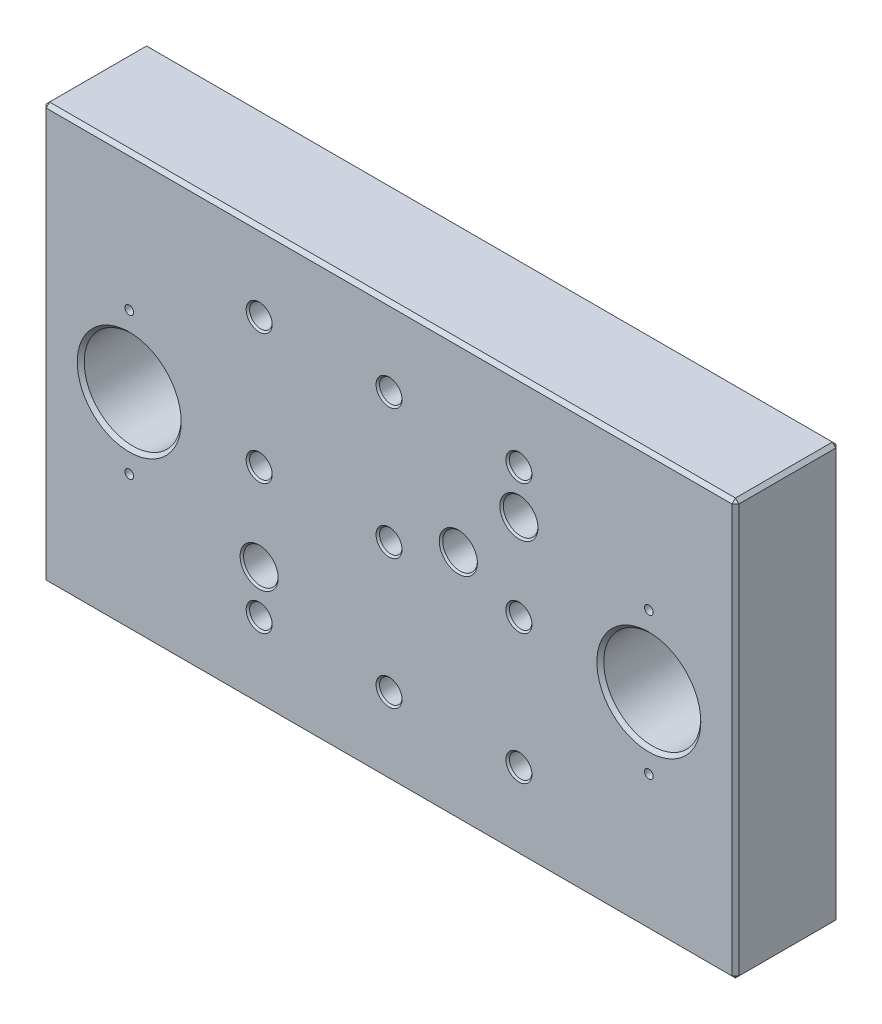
ISO-10303-21;
HEADER;
FILE_DESCRIPTION(('STEP AP214'),'2;1');
FILE_NAME('part.step','',(''),(''),'','','');
FILE_SCHEMA(('AUTOMOTIVE_DESIGN { 1 0 10303 214 1 1 1 1 }'));
ENDSEC;
DATA;
#1=APPLICATION_CONTEXT('core data for automotive mechanical design processes');
#2=APPLICATION_PROTOCOL_DEFINITION('international standard','automotive_design',2000,#1);
#3=PRODUCT_CONTEXT('',#1,'mechanical');
#4=PRODUCT('Part','Part','',(#3));
#5=PRODUCT_RELATED_PRODUCT_CATEGORY('part','',(#4));
#6=PRODUCT_DEFINITION_FORMATION('','',#4);
#7=PRODUCT_DEFINITION_CONTEXT('part definition',#1,'design');
#8=PRODUCT_DEFINITION('design','',#6,#7);
#9=PRODUCT_DEFINITION_SHAPE('','',#8);
#10=(LENGTH_UNIT() NAMED_UNIT(*) SI_UNIT(.MILLI.,.METRE.));
#11=(NAMED_UNIT(*) PLANE_ANGLE_UNIT() SI_UNIT($,.RADIAN.));
#12=(NAMED_UNIT(*) SI_UNIT($,.STERADIAN.) SOLID_ANGLE_UNIT());
#13=UNCERTAINTY_MEASURE_WITH_UNIT(LENGTH_MEASURE(1.E-05),#10,'distance_accuracy_value','');
#14=(GEOMETRIC_REPRESENTATION_CONTEXT(3) GLOBAL_UNCERTAINTY_ASSIGNED_CONTEXT((#13)) GLOBAL_UNIT_ASSIGNED_CONTEXT((#10,
#11,#12)) REPRESENTATION_CONTEXT('',''));
#15=CARTESIAN_POINT('',(0.,0.,0.));
#16=DIRECTION('',(0.,0.,1.));
#17=DIRECTION('',(1.,0.,0.));
#18=AXIS2_PLACEMENT_3D('',#15,#16,#17);
#19=CARTESIAN_POINT('',(37.5,0.,-30.));
#20=DIRECTION('',(0.,0.,1.));
#21=DIRECTION('',(1.,0.,0.));
#22=AXIS2_PLACEMENT_3D('',#19,#20,#21);
#23=CYLINDRICAL_SURFACE('',#22,3.25);
#24=CARTESIAN_POINT('',(37.5,0.,-0.500000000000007));
#25=DIRECTION('',(0.,0.,1.));
#26=DIRECTION('',(1.,0.,0.));
#27=AXIS2_PLACEMENT_3D('',#24,#25,#26);
#28=CIRCLE('',#27,3.25);
#29=CARTESIAN_POINT('',(40.75,0.,-0.500000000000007));
#30=VERTEX_POINT('',#29);
#31=EDGE_CURVE('E11',#30,#30,#28,.T.);
#32=ORIENTED_EDGE('',*,*,#31,.T.);
#33=EDGE_LOOP('',(#32));
#34=FACE_BOUND('',#33,.T.);
#35=CARTESIAN_POINT('',(37.5,0.,-10.));
#36=DIRECTION('',(0.,0.,-1.));
#37=DIRECTION('',(-1.,0.,0.));
#38=AXIS2_PLACEMENT_3D('',#35,#36,#37);
#39=CIRCLE('',#38,3.25);
#40=CARTESIAN_POINT('',(34.25,0.,-10.));
#41=VERTEX_POINT('',#40);
#42=EDGE_CURVE('E175',#41,#41,#39,.F.);
#43=ORIENTED_EDGE('',*,*,#42,.F.);
#44=EDGE_LOOP('',(#43));
#45=FACE_BOUND('',#44,.T.);
#46=ADVANCED_FACE('F41',(#34,#45),#23,.F.);
#47=CARTESIAN_POINT('',(0.,0.,-30.));
#48=DIRECTION('',(0.,0.,1.));
#49=DIRECTION('',(1.,0.,0.));
#50=AXIS2_PLACEMENT_3D('',#47,#48,#49);
#51=CYLINDRICAL_SURFACE('',#50,3.25);
#52=CARTESIAN_POINT('',(0.,0.,-0.500000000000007));
#53=DIRECTION('',(0.,0.,1.));
#54=DIRECTION('',(1.,0.,0.));
#55=AXIS2_PLACEMENT_3D('',#52,#53,#54);
#56=CIRCLE('',#55,3.25);
#57=CARTESIAN_POINT('',(3.25,0.,-0.500000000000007));
#58=VERTEX_POINT('',#57);
#59=EDGE_CURVE('E496',#58,#58,#56,.T.);
#60=ORIENTED_EDGE('',*,*,#59,.T.);
#61=EDGE_LOOP('',(#60));
#62=FACE_BOUND('',#61,.T.);
#63=CARTESIAN_POINT('',(0.,0.,-10.));
#64=DIRECTION('',(0.,0.,-1.));
#65=DIRECTION('',(-1.,0.,0.));
#66=AXIS2_PLACEMENT_3D('',#63,#64,#65);
#67=CIRCLE('',#66,3.25);
#68=CARTESIAN_POINT('',(-3.25,0.,-10.));
#69=VERTEX_POINT('',#68);
#70=EDGE_CURVE('E180',#69,#69,#67,.F.);
#71=ORIENTED_EDGE('',*,*,#70,.F.);
#72=EDGE_LOOP('',(#71));
#73=FACE_BOUND('',#72,.T.);
#74=ADVANCED_FACE('F525',(#62,#73),#51,.F.);
#75=CARTESIAN_POINT('',(0.,-37.5,-30.));
#76=DIRECTION('',(0.,0.,1.));
#77=DIRECTION('',(1.,0.,0.));
#78=AXIS2_PLACEMENT_3D('',#75,#76,#77);
#79=CYLINDRICAL_SURFACE('',#78,3.25);
#80=CARTESIAN_POINT('',(0.,-37.5,-0.500000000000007));
#81=DIRECTION('',(0.,0.,1.));
#82=DIRECTION('',(1.,0.,0.));
#83=AXIS2_PLACEMENT_3D('',#80,#81,#82);
#84=CIRCLE('',#83,3.25);
#85=CARTESIAN_POINT('',(3.25,-37.5,-0.500000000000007));
#86=VERTEX_POINT('',#85);
#87=EDGE_CURVE('E49',#86,#86,#84,.T.);
#88=ORIENTED_EDGE('',*,*,#87,.T.);
#89=EDGE_LOOP('',(#88));
#90=FACE_BOUND('',#89,.T.);
#91=CARTESIAN_POINT('',(0.,-37.5,-10.));
#92=DIRECTION('',(0.,0.,-1.));
#93=DIRECTION('',(-1.,0.,0.));
#94=AXIS2_PLACEMENT_3D('',#91,#92,#93);
#95=CIRCLE('',#94,3.25);
#96=CARTESIAN_POINT('',(-3.25,-37.5,-10.));
#97=VERTEX_POINT('',#96);
#98=EDGE_CURVE('E184',#97,#97,#95,.F.);
#99=ORIENTED_EDGE('',*,*,#98,.F.);
#100=EDGE_LOOP('',(#99));
#101=FACE_BOUND('',#100,.T.);
#102=ADVANCED_FACE('F507',(#90,#101),#79,.F.);
#103=CARTESIAN_POINT('',(-37.5,0.,-30.));
#104=DIRECTION('',(0.,0.,1.));
#105=DIRECTION('',(1.,0.,0.));
#106=AXIS2_PLACEMENT_3D('',#103,#104,#105);
#107=CYLINDRICAL_SURFACE('',#106,3.25);
#108=CARTESIAN_POINT('',(-37.5,0.,-0.500000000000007));
#109=DIRECTION('',(0.,0.,1.));
#110=DIRECTION('',(1.,0.,0.));
#111=AXIS2_PLACEMENT_3D('',#108,#109,#110);
#112=CIRCLE('',#111,3.25);
#113=CARTESIAN_POINT('',(-34.25,0.,-0.500000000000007));
#114=VERTEX_POINT('',#113);
#115=EDGE_CURVE('E490',#114,#114,#112,.T.);
#116=ORIENTED_EDGE('',*,*,#115,.T.);
#117=EDGE_LOOP('',(#116));
#118=FACE_BOUND('',#117,.T.);
#119=CARTESIAN_POINT('',(-37.5,0.,-10.));
#120=DIRECTION('',(0.,0.,-1.));
#121=DIRECTION('',(-1.,0.,0.));
#122=AXIS2_PLACEMENT_3D('',#119,#120,#121);
#123=CIRCLE('',#122,3.25);
#124=CARTESIAN_POINT('',(-40.75,0.,-10.));
#125=VERTEX_POINT('',#124);
#126=EDGE_CURVE('E188',#125,#125,#123,.F.);
#127=ORIENTED_EDGE('',*,*,#126,.F.);
#128=EDGE_LOOP('',(#127));
#129=FACE_BOUND('',#128,.T.);
#130=ADVANCED_FACE('F552',(#118,#129),#107,.F.);
#131=CARTESIAN_POINT('',(0.,37.5,-30.));
#132=DIRECTION('',(0.,0.,1.));
#133=DIRECTION('',(1.,0.,0.));
#134=AXIS2_PLACEMENT_3D('',#131,#132,#133);
#135=CYLINDRICAL_SURFACE('',#134,3.25);
#136=CARTESIAN_POINT('',(0.,37.5,-0.500000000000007));
#137=DIRECTION('',(0.,0.,1.));
#138=DIRECTION('',(1.,0.,0.));
#139=AXIS2_PLACEMENT_3D('',#136,#137,#138);
#140=CIRCLE('',#139,3.25);
#141=CARTESIAN_POINT('',(3.25,37.5,-0.500000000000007));
#142=VERTEX_POINT('',#141);
#143=EDGE_CURVE('E487',#142,#142,#140,.T.);
#144=ORIENTED_EDGE('',*,*,#143,.T.);
#145=EDGE_LOOP('',(#144));
#146=FACE_BOUND('',#145,.T.);
#147=CARTESIAN_POINT('',(0.,37.5,-10.));
#148=DIRECTION('',(0.,0.,-1.));
#149=DIRECTION('',(-1.,0.,0.));
#150=AXIS2_PLACEMENT_3D('',#147,#148,#149);
#151=CIRCLE('',#150,3.25);
#152=CARTESIAN_POINT('',(-3.25,37.5,-10.));
#153=VERTEX_POINT('',#152);
#154=EDGE_CURVE('E192',#153,#153,#151,.F.);
#155=ORIENTED_EDGE('',*,*,#154,.F.);
#156=EDGE_LOOP('',(#155));
#157=FACE_BOUND('',#156,.T.);
#158=ADVANCED_FACE('F549',(#146,#157),#135,.F.);
#159=CARTESIAN_POINT('',(37.5,-37.5,-30.));
#160=DIRECTION('',(0.,0.,1.));
#161=DIRECTION('',(1.,0.,0.));
#162=AXIS2_PLACEMENT_3D('',#159,#160,#161);
#163=CYLINDRICAL_SURFACE('',#162,3.25);
#164=CARTESIAN_POINT('',(37.5,-37.5,-0.500000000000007));
#165=DIRECTION('',(0.,0.,1.));
#166=DIRECTION('',(1.,0.,0.));
#167=AXIS2_PLACEMENT_3D('',#164,#165,#166);
#168=CIRCLE('',#167,3.25);
#169=CARTESIAN_POINT('',(40.75,-37.5,-0.500000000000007));
#170=VERTEX_POINT('',#169);
#171=EDGE_CURVE('E502',#170,#170,#168,.T.);
#172=ORIENTED_EDGE('',*,*,#171,.T.);
#173=EDGE_LOOP('',(#172));
#174=FACE_BOUND('',#173,.T.);
#175=CARTESIAN_POINT('',(37.5,-37.5,-12.5));
#176=DIRECTION('',(0.,0.,-1.));
#177=DIRECTION('',(-1.,0.,0.));
#178=AXIS2_PLACEMENT_3D('',#175,#176,#177);
#179=CIRCLE('',#178,3.25);
#180=CARTESIAN_POINT('',(34.25,-37.5,-12.5));
#181=VERTEX_POINT('',#180);
#182=EDGE_CURVE('E200',#181,#181,#179,.F.);
#183=ORIENTED_EDGE('',*,*,#182,.F.);
#184=EDGE_LOOP('',(#183));
#185=FACE_BOUND('',#184,.T.);
#186=ADVANCED_FACE('F536',(#174,#185),#163,.F.);
#187=CARTESIAN_POINT('',(-37.5,37.5,-30.));
#188=DIRECTION('',(0.,0.,1.));
#189=DIRECTION('',(1.,0.,0.));
#190=AXIS2_PLACEMENT_3D('',#187,#188,#189);
#191=CYLINDRICAL_SURFACE('',#190,3.25);
#192=CARTESIAN_POINT('',(-37.5,37.5,-0.500000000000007));
#193=DIRECTION('',(0.,0.,1.));
#194=DIRECTION('',(1.,0.,0.));
#195=AXIS2_PLACEMENT_3D('',#192,#193,#194);
#196=CIRCLE('',#195,3.25);
#197=CARTESIAN_POINT('',(-34.25,37.5,-0.500000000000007));
#198=VERTEX_POINT('',#197);
#199=EDGE_CURVE('E448',#198,#198,#196,.T.);
#200=ORIENTED_EDGE('',*,*,#199,.T.);
#201=EDGE_LOOP('',(#200));
#202=FACE_BOUND('',#201,.T.);
#203=CARTESIAN_POINT('',(-37.5,37.5,-12.5));
#204=DIRECTION('',(0.,0.,-1.));
#205=DIRECTION('',(-1.,0.,0.));
#206=AXIS2_PLACEMENT_3D('',#203,#204,#205);
#207=CIRCLE('',#206,3.25);
#208=CARTESIAN_POINT('',(-40.75,37.5,-12.5));
#209=VERTEX_POINT('',#208);
#210=EDGE_CURVE('E208',#209,#209,#207,.F.);
#211=ORIENTED_EDGE('',*,*,#210,.F.);
#212=EDGE_LOOP('',(#211));
#213=FACE_BOUND('',#212,.T.);
#214=ADVANCED_FACE('F544',(#202,#213),#191,.F.);
#215=CARTESIAN_POINT('',(-100.,60.,-30.));
#216=DIRECTION('',(-1.,0.,0.));
#217=DIRECTION('',(0.,0.,1.));
#218=AXIS2_PLACEMENT_3D('',#215,#216,#217);
#219=PLANE('',#218);
#220=DIRECTION('',(0.,-1.,0.));
#221=VECTOR('',#220,1.);
#222=CARTESIAN_POINT('',(-100.,-60.,-29.));
#223=LINE('',#222,#221);
#224=CARTESIAN_POINT('',(-100.,59.,-29.));
#225=VERTEX_POINT('',#224);
#226=CARTESIAN_POINT('',(-100.,-59.,-29.));
#227=VERTEX_POINT('',#226);
#228=EDGE_CURVE('E279',#225,#227,#223,.T.);
#229=ORIENTED_EDGE('',*,*,#228,.T.);
#230=DIRECTION('',(0.,0.,1.));
#231=VECTOR('',#230,1.);
#232=CARTESIAN_POINT('',(-100.,-59.,-30.));
#233=LINE('',#232,#231);
#234=CARTESIAN_POINT('',(-100.,-59.,-1.00000000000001));
#235=VERTEX_POINT('',#234);
#236=EDGE_CURVE('E281',#227,#235,#233,.T.);
#237=ORIENTED_EDGE('',*,*,#236,.T.);
#238=DIRECTION('',(0.,1.,0.));
#239=VECTOR('',#238,1.);
#240=CARTESIAN_POINT('',(-100.,60.,-1.00000000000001));
#241=LINE('',#240,#239);
#242=CARTESIAN_POINT('',(-100.,59.,-1.00000000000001));
#243=VERTEX_POINT('',#242);
#244=EDGE_CURVE('E275',#235,#243,#241,.T.);
#245=ORIENTED_EDGE('',*,*,#244,.T.);
#246=DIRECTION('',(0.,0.,-1.));
#247=VECTOR('',#246,1.);
#248=CARTESIAN_POINT('',(-100.,59.,-30.));
#249=LINE('',#248,#247);
#250=EDGE_CURVE('E277',#243,#225,#249,.T.);
#251=ORIENTED_EDGE('',*,*,#250,.T.);
#252=EDGE_LOOP('',(#229,#237,#245,#251));
#253=FACE_BOUND('',#252,.T.);
#254=ADVANCED_FACE('F547',(#253),#219,.T.);
#255=CARTESIAN_POINT('',(-100.,60.,-30.));
#256=DIRECTION('',(0.,1.,0.));
#257=DIRECTION('',(-1.,0.,0.));
#258=AXIS2_PLACEMENT_3D('',#255,#256,#257);
#259=PLANE('',#258);
#260=DIRECTION('',(-1.,0.,0.));
#261=VECTOR('',#260,1.);
#262=CARTESIAN_POINT('',(-100.,60.,-29.));
#263=LINE('',#262,#261);
#264=CARTESIAN_POINT('',(99.,60.,-29.));
#265=VERTEX_POINT('',#264);
#266=CARTESIAN_POINT('',(-99.,60.,-29.));
#267=VERTEX_POINT('',#266);
#268=EDGE_CURVE('E270',#265,#267,#263,.T.);
#269=ORIENTED_EDGE('',*,*,#268,.T.);
#270=DIRECTION('',(0.,0.,1.));
#271=VECTOR('',#270,1.);
#272=CARTESIAN_POINT('',(-99.,60.,-30.));
#273=LINE('',#272,#271);
#274=CARTESIAN_POINT('',(-99.,60.,-1.00000000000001));
#275=VERTEX_POINT('',#274);
#276=EDGE_CURVE('E273',#267,#275,#273,.T.);
#277=ORIENTED_EDGE('',*,*,#276,.T.);
#278=DIRECTION('',(1.,0.,0.));
#279=VECTOR('',#278,1.);
#280=CARTESIAN_POINT('',(-100.,60.,-1.00000000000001));
#281=LINE('',#280,#279);
#282=CARTESIAN_POINT('',(99.,60.,-1.00000000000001));
#283=VERTEX_POINT('',#282);
#284=EDGE_CURVE('E268',#275,#283,#281,.T.);
#285=ORIENTED_EDGE('',*,*,#284,.T.);
#286=DIRECTION('',(0.,0.,-1.));
#287=VECTOR('',#286,1.);
#288=CARTESIAN_POINT('',(99.,60.,-30.));
#289=LINE('',#288,#287);
#290=EDGE_CURVE('E266',#283,#265,#289,.T.);
#291=ORIENTED_EDGE('',*,*,#290,.T.);
#292=EDGE_LOOP('',(#269,#277,#285,#291));
#293=FACE_BOUND('',#292,.T.);
#294=ADVANCED_FACE('F566',(#293),#259,.T.);
#295=CARTESIAN_POINT('',(100.,60.,-30.));
#296=DIRECTION('',(1.,0.,0.));
#297=DIRECTION('',(0.,0.,-1.));
#298=AXIS2_PLACEMENT_3D('',#295,#296,#297);
#299=PLANE('',#298);
#300=DIRECTION('',(0.,1.,0.));
#301=VECTOR('',#300,1.);
#302=CARTESIAN_POINT('',(100.,60.,-29.));
#303=LINE('',#302,#301);
#304=CARTESIAN_POINT('',(100.,-59.,-29.));
#305=VERTEX_POINT('',#304);
#306=CARTESIAN_POINT('',(100.,59.,-29.));
#307=VERTEX_POINT('',#306);
#308=EDGE_CURVE('E56',#305,#307,#303,.T.);
#309=ORIENTED_EDGE('',*,*,#308,.T.);
#310=DIRECTION('',(0.,0.,1.));
#311=VECTOR('',#310,1.);
#312=CARTESIAN_POINT('',(100.,59.,-30.));
#313=LINE('',#312,#311);
#314=CARTESIAN_POINT('',(100.,59.,-1.00000000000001));
#315=VERTEX_POINT('',#314);
#316=EDGE_CURVE('E288',#307,#315,#313,.T.);
#317=ORIENTED_EDGE('',*,*,#316,.T.);
#318=DIRECTION('',(0.,-1.,0.));
#319=VECTOR('',#318,1.);
#320=CARTESIAN_POINT('',(100.,60.,-1.00000000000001));
#321=LINE('',#320,#319);
#322=CARTESIAN_POINT('',(100.,-59.,-1.00000000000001));
#323=VERTEX_POINT('',#322);
#324=EDGE_CURVE('E284',#315,#323,#321,.T.);
#325=ORIENTED_EDGE('',*,*,#324,.T.);
#326=DIRECTION('',(0.,0.,-1.));
#327=VECTOR('',#326,1.);
#328=CARTESIAN_POINT('',(100.,-59.,-30.));
#329=LINE('',#328,#327);
#330=EDGE_CURVE('E61',#323,#305,#329,.T.);
#331=ORIENTED_EDGE('',*,*,#330,.T.);
#332=EDGE_LOOP('',(#309,#317,#325,#331));
#333=FACE_BOUND('',#332,.T.);
#334=ADVANCED_FACE('F569',(#333),#299,.T.);
#335=CARTESIAN_POINT('',(-100.,-60.,-30.));
#336=DIRECTION('',(0.,-1.,0.));
#337=DIRECTION('',(1.,0.,0.));
#338=AXIS2_PLACEMENT_3D('',#335,#336,#337);
#339=PLANE('',#338);
#340=DIRECTION('',(-1.,0.,0.));
#341=VECTOR('',#340,1.);
#342=CARTESIAN_POINT('',(-100.,-60.,-1.00000000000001));
#343=LINE('',#342,#341);
#344=CARTESIAN_POINT('',(99.,-60.,-1.00000000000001));
#345=VERTEX_POINT('',#344);
#346=CARTESIAN_POINT('',(-99.,-60.,-1.00000000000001));
#347=VERTEX_POINT('',#346);
#348=EDGE_CURVE('E229',#345,#347,#343,.T.);
#349=ORIENTED_EDGE('',*,*,#348,.T.);
#350=DIRECTION('',(0.,0.,-1.));
#351=VECTOR('',#350,1.);
#352=CARTESIAN_POINT('',(-99.,-60.,-30.));
#353=LINE('',#352,#351);
#354=CARTESIAN_POINT('',(-99.,-60.,-29.));
#355=VERTEX_POINT('',#354);
#356=EDGE_CURVE('E234',#347,#355,#353,.T.);
#357=ORIENTED_EDGE('',*,*,#356,.T.);
#358=DIRECTION('',(1.,0.,0.));
#359=VECTOR('',#358,1.);
#360=CARTESIAN_POINT('',(100.,-60.,-29.));
#361=LINE('',#360,#359);
#362=CARTESIAN_POINT('',(99.,-60.,-29.));
#363=VERTEX_POINT('',#362);
#364=EDGE_CURVE('E231',#355,#363,#361,.T.);
#365=ORIENTED_EDGE('',*,*,#364,.T.);
#366=DIRECTION('',(0.,0.,1.));
#367=VECTOR('',#366,1.);
#368=CARTESIAN_POINT('',(99.,-60.,-30.));
#369=LINE('',#368,#367);
#370=EDGE_CURVE('E211',#363,#345,#369,.T.);
#371=ORIENTED_EDGE('',*,*,#370,.T.);
#372=EDGE_LOOP('',(#349,#357,#365,#371));
#373=FACE_BOUND('',#372,.T.);
#374=ADVANCED_FACE('F561',(#373),#339,.T.);
#375=CARTESIAN_POINT('',(-100.,-60.,-30.));
#376=DIRECTION('',(0.,0.,1.));
#377=DIRECTION('',(1.,0.,0.));
#378=AXIS2_PLACEMENT_3D('',#375,#376,#377);
#379=PLANE('',#378);
#380=CARTESIAN_POINT('',(37.5,-37.5,-30.));
#381=DIRECTION('',(0.,0.,1.));
#382=DIRECTION('',(1.,0.,0.));
#383=AXIS2_PLACEMENT_3D('',#380,#381,#382);
#384=CIRCLE('',#383,5.5);
#385=CARTESIAN_POINT('',(43.,-37.5,-30.));
#386=VERTEX_POINT('',#385);
#387=EDGE_CURVE('E403',#386,#386,#384,.T.);
#388=ORIENTED_EDGE('',*,*,#387,.T.);
#389=EDGE_LOOP('',(#388));
#390=FACE_BOUND('',#389,.T.);
#391=CARTESIAN_POINT('',(20.,7.50000000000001,-30.));
#392=DIRECTION('',(0.,0.,1.));
#393=DIRECTION('',(1.,0.,0.));
#394=AXIS2_PLACEMENT_3D('',#391,#392,#393);
#395=CIRCLE('',#394,5.50000000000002);
#396=CARTESIAN_POINT('',(25.5,7.50000000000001,-30.));
#397=VERTEX_POINT('',#396);
#398=EDGE_CURVE('E400',#397,#397,#395,.T.);
#399=ORIENTED_EDGE('',*,*,#398,.T.);
#400=EDGE_LOOP('',(#399));
#401=FACE_BOUND('',#400,.T.);
#402=CARTESIAN_POINT('',(37.5,0.,-30.));
#403=DIRECTION('',(0.,0.,1.));
#404=DIRECTION('',(1.,0.,0.));
#405=AXIS2_PLACEMENT_3D('',#402,#403,#404);
#406=CIRCLE('',#405,6.5);
#407=CARTESIAN_POINT('',(44.,0.,-30.));
#408=VERTEX_POINT('',#407);
#409=EDGE_CURVE('E397',#408,#408,#406,.T.);
#410=ORIENTED_EDGE('',*,*,#409,.T.);
#411=EDGE_LOOP('',(#410));
#412=FACE_BOUND('',#411,.T.);
#413=CARTESIAN_POINT('',(37.5,25.,-30.));
#414=DIRECTION('',(0.,0.,1.));
#415=DIRECTION('',(1.,0.,0.));
#416=AXIS2_PLACEMENT_3D('',#413,#414,#415);
#417=CIRCLE('',#416,5.50000000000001);
#418=CARTESIAN_POINT('',(43.,25.,-30.));
#419=VERTEX_POINT('',#418);
#420=EDGE_CURVE('E394',#419,#419,#417,.T.);
#421=ORIENTED_EDGE('',*,*,#420,.T.);
#422=EDGE_LOOP('',(#421));
#423=FACE_BOUND('',#422,.T.);
#424=CARTESIAN_POINT('',(37.5,37.5,-30.));
#425=DIRECTION('',(0.,0.,1.));
#426=DIRECTION('',(1.,0.,0.));
#427=AXIS2_PLACEMENT_3D('',#424,#425,#426);
#428=CIRCLE('',#427,5.5);
#429=CARTESIAN_POINT('',(43.,37.5,-30.));
#430=VERTEX_POINT('',#429);
#431=EDGE_CURVE('E391',#430,#430,#428,.T.);
#432=ORIENTED_EDGE('',*,*,#431,.T.);
#433=EDGE_LOOP('',(#432));
#434=FACE_BOUND('',#433,.T.);
#435=CARTESIAN_POINT('',(0.,37.5,-30.));
#436=DIRECTION('',(0.,0.,1.));
#437=DIRECTION('',(1.,0.,0.));
#438=AXIS2_PLACEMENT_3D('',#435,#436,#437);
#439=CIRCLE('',#438,6.5);
#440=CARTESIAN_POINT('',(6.5,37.5,-30.));
#441=VERTEX_POINT('',#440);
#442=EDGE_CURVE('E388',#441,#441,#439,.T.);
#443=ORIENTED_EDGE('',*,*,#442,.T.);
#444=EDGE_LOOP('',(#443));
#445=FACE_BOUND('',#444,.T.);
#446=CARTESIAN_POINT('',(0.,0.,-30.));
#447=DIRECTION('',(0.,0.,1.));
#448=DIRECTION('',(1.,0.,0.));
#449=AXIS2_PLACEMENT_3D('',#446,#447,#448);
#450=CIRCLE('',#449,6.50000000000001);
#451=CARTESIAN_POINT('',(6.50000000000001,0.,-30.));
#452=VERTEX_POINT('',#451);
#453=EDGE_CURVE('E385',#452,#452,#450,.T.);
#454=ORIENTED_EDGE('',*,*,#453,.T.);
#455=EDGE_LOOP('',(#454));
#456=FACE_BOUND('',#455,.T.);
#457=CARTESIAN_POINT('',(0.,-37.5,-30.));
#458=DIRECTION('',(0.,0.,1.));
#459=DIRECTION('',(1.,0.,0.));
#460=AXIS2_PLACEMENT_3D('',#457,#458,#459);
#461=CIRCLE('',#460,6.5);
#462=CARTESIAN_POINT('',(6.5,-37.5,-30.));
#463=VERTEX_POINT('',#462);
#464=EDGE_CURVE('E382',#463,#463,#461,.T.);
#465=ORIENTED_EDGE('',*,*,#464,.T.);
#466=EDGE_LOOP('',(#465));
#467=FACE_BOUND('',#466,.T.);
#468=CARTESIAN_POINT('',(-37.5,-37.5,-30.));
#469=DIRECTION('',(0.,0.,1.));
#470=DIRECTION('',(1.,0.,0.));
#471=AXIS2_PLACEMENT_3D('',#468,#469,#470);
#472=CIRCLE('',#471,5.5);
#473=CARTESIAN_POINT('',(-32.,-37.5,-30.));
#474=VERTEX_POINT('',#473);
#475=EDGE_CURVE('E379',#474,#474,#472,.T.);
#476=ORIENTED_EDGE('',*,*,#475,.T.);
#477=EDGE_LOOP('',(#476));
#478=FACE_BOUND('',#477,.T.);
#479=CARTESIAN_POINT('',(-37.5,-25.,-30.));
#480=DIRECTION('',(0.,0.,1.));
#481=DIRECTION('',(1.,0.,0.));
#482=AXIS2_PLACEMENT_3D('',#479,#480,#481);
#483=CIRCLE('',#482,5.50000000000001);
#484=CARTESIAN_POINT('',(-32.,-25.,-30.));
#485=VERTEX_POINT('',#484);
#486=EDGE_CURVE('E376',#485,#485,#483,.T.);
#487=ORIENTED_EDGE('',*,*,#486,.T.);
#488=EDGE_LOOP('',(#487));
#489=FACE_BOUND('',#488,.T.);
#490=CARTESIAN_POINT('',(-37.5,0.,-30.));
#491=DIRECTION('',(0.,0.,1.));
#492=DIRECTION('',(1.,0.,0.));
#493=AXIS2_PLACEMENT_3D('',#490,#491,#492);
#494=CIRCLE('',#493,6.5);
#495=CARTESIAN_POINT('',(-31.,0.,-30.));
#496=VERTEX_POINT('',#495);
#497=EDGE_CURVE('E373',#496,#496,#494,.T.);
#498=ORIENTED_EDGE('',*,*,#497,.T.);
#499=EDGE_LOOP('',(#498));
#500=FACE_BOUND('',#499,.T.);
#501=CARTESIAN_POINT('',(-37.5,37.5,-30.));
#502=DIRECTION('',(0.,0.,1.));
#503=DIRECTION('',(1.,0.,0.));
#504=AXIS2_PLACEMENT_3D('',#501,#502,#503);
#505=CIRCLE('',#504,5.5);
#506=CARTESIAN_POINT('',(-32.,37.5,-30.));
#507=VERTEX_POINT('',#506);
#508=EDGE_CURVE('E370',#507,#507,#505,.T.);
#509=ORIENTED_EDGE('',*,*,#508,.T.);
#510=EDGE_LOOP('',(#509));
#511=FACE_BOUND('',#510,.T.);
#512=DIRECTION('',(-1.,0.,0.));
#513=VECTOR('',#512,1.);
#514=CARTESIAN_POINT('',(-100.,-59.,-30.));
#515=LINE('',#514,#513);
#516=CARTESIAN_POINT('',(99.,-59.,-30.));
#517=VERTEX_POINT('',#516);
#518=CARTESIAN_POINT('',(-99.,-59.,-30.));
#519=VERTEX_POINT('',#518);
#520=EDGE_CURVE('E246',#517,#519,#515,.T.);
#521=ORIENTED_EDGE('',*,*,#520,.T.);
#522=DIRECTION('',(0.,1.,0.));
#523=VECTOR('',#522,1.);
#524=CARTESIAN_POINT('',(-99.,60.,-30.));
#525=LINE('',#524,#523);
#526=CARTESIAN_POINT('',(-99.,59.,-30.));
#527=VERTEX_POINT('',#526);
#528=EDGE_CURVE('E249',#519,#527,#525,.T.);
#529=ORIENTED_EDGE('',*,*,#528,.T.);
#530=DIRECTION('',(1.,0.,0.));
#531=VECTOR('',#530,1.);
#532=CARTESIAN_POINT('',(100.,59.,-30.));
#533=LINE('',#532,#531);
#534=CARTESIAN_POINT('',(99.,59.,-30.));
#535=VERTEX_POINT('',#534);
#536=EDGE_CURVE('E244',#527,#535,#533,.T.);
#537=ORIENTED_EDGE('',*,*,#536,.T.);
#538=DIRECTION('',(0.,-1.,0.));
#539=VECTOR('',#538,1.);
#540=CARTESIAN_POINT('',(99.,-60.,-30.));
#541=LINE('',#540,#539);
#542=EDGE_CURVE('E242',#535,#517,#541,.T.);
#543=ORIENTED_EDGE('',*,*,#542,.T.);
#544=EDGE_LOOP('',(#521,#529,#537,#543));
#545=FACE_BOUND('',#544,.T.);
#546=CARTESIAN_POINT('',(-75.,0.,-30.));
#547=DIRECTION('',(0.,0.,1.));
#548=DIRECTION('',(1.,0.,0.));
#549=AXIS2_PLACEMENT_3D('',#546,#547,#548);
#550=CIRCLE('',#549,15.);
#551=CARTESIAN_POINT('',(-60.,0.,-30.));
#552=VERTEX_POINT('',#551);
#553=EDGE_CURVE('E239',#552,#552,#550,.T.);
#554=ORIENTED_EDGE('',*,*,#553,.T.);
#555=EDGE_LOOP('',(#554));
#556=FACE_BOUND('',#555,.T.);
#557=CARTESIAN_POINT('',(75.,0.,-30.));
#558=DIRECTION('',(0.,0.,1.));
#559=DIRECTION('',(1.,0.,0.));
#560=AXIS2_PLACEMENT_3D('',#557,#558,#559);
#561=CIRCLE('',#560,15.);
#562=CARTESIAN_POINT('',(90.,0.,-30.));
#563=VERTEX_POINT('',#562);
#564=EDGE_CURVE('E236',#563,#563,#561,.T.);
#565=ORIENTED_EDGE('',*,*,#564,.T.);
#566=EDGE_LOOP('',(#565));
#567=FACE_BOUND('',#566,.T.);
#568=ADVANCED_FACE('F558',(#390,#401,#412,#423,#434,#445,#456,#467,#478,#489,#500,#511,#545,
#556,#567),#379,.F.);
#569=CARTESIAN_POINT('',(-100.,-60.,0.));
#570=DIRECTION('',(0.,0.,1.));
#571=DIRECTION('',(1.,0.,0.));
#572=AXIS2_PLACEMENT_3D('',#569,#570,#571);
#573=PLANE('',#572);
#574=CARTESIAN_POINT('',(-75.,20.5,0.));
#575=DIRECTION('',(0.,0.,1.));
#576=DIRECTION('',(1.,0.,0.));
#577=AXIS2_PLACEMENT_3D('',#574,#575,#576);
#578=CIRCLE('',#577,1.25);
#579=CARTESIAN_POINT('',(-73.75,20.5,0.));
#580=VERTEX_POINT('',#579);
#581=EDGE_CURVE('E148',#580,#580,#578,.T.);
#582=ORIENTED_EDGE('',*,*,#581,.F.);
#583=EDGE_LOOP('',(#582));
#584=FACE_BOUND('',#583,.T.);
#585=CARTESIAN_POINT('',(-75.,-20.5,0.));
#586=DIRECTION('',(0.,0.,1.));
#587=DIRECTION('',(1.,0.,0.));
#588=AXIS2_PLACEMENT_3D('',#585,#586,#587);
#589=CIRCLE('',#588,1.25);
#590=CARTESIAN_POINT('',(-73.75,-20.5,0.));
#591=VERTEX_POINT('',#590);
#592=EDGE_CURVE('E156',#591,#591,#589,.T.);
#593=ORIENTED_EDGE('',*,*,#592,.F.);
#594=EDGE_LOOP('',(#593));
#595=FACE_BOUND('',#594,.T.);
#596=CARTESIAN_POINT('',(75.,-20.5,0.));
#597=DIRECTION('',(0.,0.,1.));
#598=DIRECTION('',(1.,0.,0.));
#599=AXIS2_PLACEMENT_3D('',#596,#597,#598);
#600=CIRCLE('',#599,1.25);
#601=CARTESIAN_POINT('',(76.25,-20.5,0.));
#602=VERTEX_POINT('',#601);
#603=EDGE_CURVE('E162',#602,#602,#600,.T.);
#604=ORIENTED_EDGE('',*,*,#603,.F.);
#605=EDGE_LOOP('',(#604));
#606=FACE_BOUND('',#605,.T.);
#607=CARTESIAN_POINT('',(75.,20.5,0.));
#608=DIRECTION('',(0.,0.,1.));
#609=DIRECTION('',(1.,0.,0.));
#610=AXIS2_PLACEMENT_3D('',#607,#608,#609);
#611=CIRCLE('',#610,1.25);
#612=CARTESIAN_POINT('',(76.25,20.5,0.));
#613=VERTEX_POINT('',#612);
#614=EDGE_CURVE('E168',#613,#613,#611,.T.);
#615=ORIENTED_EDGE('',*,*,#614,.F.);
#616=EDGE_LOOP('',(#615));
#617=FACE_BOUND('',#616,.T.);
#618=CARTESIAN_POINT('',(-37.5,37.5,0.));
#619=DIRECTION('',(0.,0.,1.));
#620=DIRECTION('',(1.,0.,0.));
#621=AXIS2_PLACEMENT_3D('',#618,#619,#620);
#622=CIRCLE('',#621,3.75);
#623=CARTESIAN_POINT('',(-33.75,37.5,0.));
#624=VERTEX_POINT('',#623);
#625=EDGE_CURVE('E484',#624,#624,#622,.F.);
#626=ORIENTED_EDGE('',*,*,#625,.T.);
#627=EDGE_LOOP('',(#626));
#628=FACE_BOUND('',#627,.T.);
#629=CARTESIAN_POINT('',(0.,37.5,0.));
#630=DIRECTION('',(0.,0.,1.));
#631=DIRECTION('',(1.,0.,0.));
#632=AXIS2_PLACEMENT_3D('',#629,#630,#631);
#633=CIRCLE('',#632,3.75);
#634=CARTESIAN_POINT('',(3.75,37.5,0.));
#635=VERTEX_POINT('',#634);
#636=EDGE_CURVE('E481',#635,#635,#633,.F.);
#637=ORIENTED_EDGE('',*,*,#636,.T.);
#638=EDGE_LOOP('',(#637));
#639=FACE_BOUND('',#638,.T.);
#640=CARTESIAN_POINT('',(-37.5,0.,0.));
#641=DIRECTION('',(0.,0.,1.));
#642=DIRECTION('',(1.,0.,0.));
#643=AXIS2_PLACEMENT_3D('',#640,#641,#642);
#644=CIRCLE('',#643,3.75);
#645=CARTESIAN_POINT('',(-33.75,0.,0.));
#646=VERTEX_POINT('',#645);
#647=EDGE_CURVE('E478',#646,#646,#644,.F.);
#648=ORIENTED_EDGE('',*,*,#647,.T.);
#649=EDGE_LOOP('',(#648));
#650=FACE_BOUND('',#649,.T.);
#651=CARTESIAN_POINT('',(-37.5,-25.,0.));
#652=DIRECTION('',(0.,0.,1.));
#653=DIRECTION('',(1.,0.,0.));
#654=AXIS2_PLACEMENT_3D('',#651,#652,#653);
#655=CIRCLE('',#654,5.5);
#656=CARTESIAN_POINT('',(-32.,-25.,0.));
#657=VERTEX_POINT('',#656);
#658=EDGE_CURVE('E475',#657,#657,#655,.F.);
#659=ORIENTED_EDGE('',*,*,#658,.T.);
#660=EDGE_LOOP('',(#659));
#661=FACE_BOUND('',#660,.T.);
#662=CARTESIAN_POINT('',(-37.5,-37.5,0.));
#663=DIRECTION('',(0.,0.,1.));
#664=DIRECTION('',(1.,0.,0.));
#665=AXIS2_PLACEMENT_3D('',#662,#663,#664);
#666=CIRCLE('',#665,3.75);
#667=CARTESIAN_POINT('',(-33.75,-37.5,0.));
#668=VERTEX_POINT('',#667);
#669=EDGE_CURVE('E472',#668,#668,#666,.F.);
#670=ORIENTED_EDGE('',*,*,#669,.T.);
#671=EDGE_LOOP('',(#670));
#672=FACE_BOUND('',#671,.T.);
#673=CARTESIAN_POINT('',(0.,0.,0.));
#674=DIRECTION('',(0.,0.,1.));
#675=DIRECTION('',(1.,0.,0.));
#676=AXIS2_PLACEMENT_3D('',#673,#674,#675);
#677=CIRCLE('',#676,3.75);
#678=CARTESIAN_POINT('',(3.75,0.,0.));
#679=VERTEX_POINT('',#678);
#680=EDGE_CURVE('E469',#679,#679,#677,.F.);
#681=ORIENTED_EDGE('',*,*,#680,.T.);
#682=EDGE_LOOP('',(#681));
#683=FACE_BOUND('',#682,.T.);
#684=CARTESIAN_POINT('',(20.,7.50000000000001,0.));
#685=DIRECTION('',(0.,0.,1.));
#686=DIRECTION('',(1.,0.,0.));
#687=AXIS2_PLACEMENT_3D('',#684,#685,#686);
#688=CIRCLE('',#687,5.50000000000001);
#689=CARTESIAN_POINT('',(25.5,7.50000000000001,0.));
#690=VERTEX_POINT('',#689);
#691=EDGE_CURVE('E466',#690,#690,#688,.F.);
#692=ORIENTED_EDGE('',*,*,#691,.T.);
#693=EDGE_LOOP('',(#692));
#694=FACE_BOUND('',#693,.T.);
#695=CARTESIAN_POINT('',(37.5,25.,0.));
#696=DIRECTION('',(0.,0.,1.));
#697=DIRECTION('',(1.,0.,0.));
#698=AXIS2_PLACEMENT_3D('',#695,#696,#697);
#699=CIRCLE('',#698,5.50000000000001);
#700=CARTESIAN_POINT('',(43.,25.,0.));
#701=VERTEX_POINT('',#700);
#702=EDGE_CURVE('E463',#701,#701,#699,.F.);
#703=ORIENTED_EDGE('',*,*,#702,.T.);
#704=EDGE_LOOP('',(#703));
#705=FACE_BOUND('',#704,.T.);
#706=CARTESIAN_POINT('',(37.5,37.5,0.));
#707=DIRECTION('',(0.,0.,1.));
#708=DIRECTION('',(1.,0.,0.));
#709=AXIS2_PLACEMENT_3D('',#706,#707,#708);
#710=CIRCLE('',#709,3.75);
#711=CARTESIAN_POINT('',(41.25,37.5,0.));
#712=VERTEX_POINT('',#711);
#713=EDGE_CURVE('E460',#712,#712,#710,.F.);
#714=ORIENTED_EDGE('',*,*,#713,.T.);
#715=EDGE_LOOP('',(#714));
#716=FACE_BOUND('',#715,.T.);
#717=CARTESIAN_POINT('',(37.5,-37.5,0.));
#718=DIRECTION('',(0.,0.,1.));
#719=DIRECTION('',(1.,0.,0.));
#720=AXIS2_PLACEMENT_3D('',#717,#718,#719);
#721=CIRCLE('',#720,3.75);
#722=CARTESIAN_POINT('',(41.25,-37.5,0.));
#723=VERTEX_POINT('',#722);
#724=EDGE_CURVE('E457',#723,#723,#721,.F.);
#725=ORIENTED_EDGE('',*,*,#724,.T.);
#726=EDGE_LOOP('',(#725));
#727=FACE_BOUND('',#726,.T.);
#728=CARTESIAN_POINT('',(0.,-37.5,0.));
#729=DIRECTION('',(0.,0.,1.));
#730=DIRECTION('',(1.,0.,0.));
#731=AXIS2_PLACEMENT_3D('',#728,#729,#730);
#732=CIRCLE('',#731,3.75);
#733=CARTESIAN_POINT('',(3.75,-37.5,0.));
#734=VERTEX_POINT('',#733);
#735=EDGE_CURVE('E454',#734,#734,#732,.F.);
#736=ORIENTED_EDGE('',*,*,#735,.T.);
#737=EDGE_LOOP('',(#736));
#738=FACE_BOUND('',#737,.T.);
#739=CARTESIAN_POINT('',(37.5,0.,0.));
#740=DIRECTION('',(0.,0.,1.));
#741=DIRECTION('',(1.,0.,0.));
#742=AXIS2_PLACEMENT_3D('',#739,#740,#741);
#743=CIRCLE('',#742,3.75);
#744=CARTESIAN_POINT('',(41.25,0.,0.));
#745=VERTEX_POINT('',#744);
#746=EDGE_CURVE('E451',#745,#745,#743,.F.);
#747=ORIENTED_EDGE('',*,*,#746,.T.);
#748=EDGE_LOOP('',(#747));
#749=FACE_BOUND('',#748,.T.);
#750=DIRECTION('',(-1.,0.,0.));
#751=VECTOR('',#750,1.);
#752=CARTESIAN_POINT('',(-100.,59.,0.));
#753=LINE('',#752,#751);
#754=CARTESIAN_POINT('',(99.,59.,0.));
#755=VERTEX_POINT('',#754);
#756=CARTESIAN_POINT('',(-99.,59.,0.));
#757=VERTEX_POINT('',#756);
#758=EDGE_CURVE('E259',#755,#757,#753,.T.);
#759=ORIENTED_EDGE('',*,*,#758,.T.);
#760=DIRECTION('',(0.,-1.,0.));
#761=VECTOR('',#760,1.);
#762=CARTESIAN_POINT('',(-99.,-60.,0.));
#763=LINE('',#762,#761);
#764=CARTESIAN_POINT('',(-99.,-59.,0.));
#765=VERTEX_POINT('',#764);
#766=EDGE_CURVE('E264',#757,#765,#763,.T.);
#767=ORIENTED_EDGE('',*,*,#766,.T.);
#768=DIRECTION('',(1.,0.,0.));
#769=VECTOR('',#768,1.);
#770=CARTESIAN_POINT('',(-100.,-59.,0.));
#771=LINE('',#770,#769);
#772=CARTESIAN_POINT('',(99.,-59.,0.));
#773=VERTEX_POINT('',#772);
#774=EDGE_CURVE('E261',#765,#773,#771,.T.);
#775=ORIENTED_EDGE('',*,*,#774,.T.);
#776=DIRECTION('',(0.,1.,0.));
#777=VECTOR('',#776,1.);
#778=CARTESIAN_POINT('',(99.,-60.,0.));
#779=LINE('',#778,#777);
#780=EDGE_CURVE('E257',#773,#755,#779,.T.);
#781=ORIENTED_EDGE('',*,*,#780,.T.);
#782=EDGE_LOOP('',(#759,#767,#775,#781));
#783=FACE_BOUND('',#782,.T.);
#784=CARTESIAN_POINT('',(-75.,0.,0.));
#785=DIRECTION('',(0.,0.,1.));
#786=DIRECTION('',(1.,0.,0.));
#787=AXIS2_PLACEMENT_3D('',#784,#785,#786);
#788=CIRCLE('',#787,15.);
#789=CARTESIAN_POINT('',(-60.,0.,0.));
#790=VERTEX_POINT('',#789);
#791=EDGE_CURVE('E254',#790,#790,#788,.F.);
#792=ORIENTED_EDGE('',*,*,#791,.T.);
#793=EDGE_LOOP('',(#792));
#794=FACE_BOUND('',#793,.T.);
#795=CARTESIAN_POINT('',(75.,0.,0.));
#796=DIRECTION('',(0.,0.,1.));
#797=DIRECTION('',(1.,0.,0.));
#798=AXIS2_PLACEMENT_3D('',#795,#796,#797);
#799=CIRCLE('',#798,15.);
#800=CARTESIAN_POINT('',(90.,0.,0.));
#801=VERTEX_POINT('',#800);
#802=EDGE_CURVE('E251',#801,#801,#799,.F.);
#803=ORIENTED_EDGE('',*,*,#802,.T.);
#804=EDGE_LOOP('',(#803));
#805=FACE_BOUND('',#804,.T.);
#806=ADVANCED_FACE('F556',(#584,#595,#606,#617,#628,#639,#650,#661,#672,#683,#694,#705,#716,
#727,#738,#749,#783,#794,#805),#573,.T.);
#807=CARTESIAN_POINT('',(37.5,25.,-30.));
#808=DIRECTION('',(0.,0.,1.));
#809=DIRECTION('',(1.,0.,0.));
#810=AXIS2_PLACEMENT_3D('',#807,#808,#809);
#811=CYLINDRICAL_SURFACE('',#810,5.);
#812=CARTESIAN_POINT('',(37.5,25.,-29.5));
#813=DIRECTION('',(0.,0.,1.));
#814=DIRECTION('',(1.,0.,0.));
#815=AXIS2_PLACEMENT_3D('',#812,#813,#814);
#816=CIRCLE('',#815,5.);
#817=CARTESIAN_POINT('',(42.5,25.,-29.5));
#818=VERTEX_POINT('',#817);
#819=EDGE_CURVE('E418',#818,#818,#816,.F.);
#820=ORIENTED_EDGE('',*,*,#819,.T.);
#821=EDGE_LOOP('',(#820));
#822=FACE_BOUND('',#821,.T.);
#823=CARTESIAN_POINT('',(37.5,25.,-0.500000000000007));
#824=DIRECTION('',(0.,0.,1.));
#825=DIRECTION('',(1.,0.,0.));
#826=AXIS2_PLACEMENT_3D('',#823,#824,#825);
#827=CIRCLE('',#826,5.);
#828=CARTESIAN_POINT('',(42.5,25.,-0.500000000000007));
#829=VERTEX_POINT('',#828);
#830=EDGE_CURVE('E415',#829,#829,#827,.T.);
#831=ORIENTED_EDGE('',*,*,#830,.T.);
#832=EDGE_LOOP('',(#831));
#833=FACE_BOUND('',#832,.T.);
#834=ADVANCED_FACE('F542',(#822,#833),#811,.F.);
#835=CARTESIAN_POINT('',(37.5,37.5,-30.));
#836=DIRECTION('',(0.,0.,1.));
#837=DIRECTION('',(1.,0.,0.));
#838=AXIS2_PLACEMENT_3D('',#835,#836,#837);
#839=CYLINDRICAL_SURFACE('',#838,3.25);
#840=CARTESIAN_POINT('',(37.5,37.5,-0.500000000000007));
#841=DIRECTION('',(0.,0.,1.));
#842=DIRECTION('',(1.,0.,0.));
#843=AXIS2_PLACEMENT_3D('',#840,#841,#842);
#844=CIRCLE('',#843,3.25);
#845=CARTESIAN_POINT('',(40.75,37.5,-0.500000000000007));
#846=VERTEX_POINT('',#845);
#847=EDGE_CURVE('E499',#846,#846,#844,.T.);
#848=ORIENTED_EDGE('',*,*,#847,.T.);
#849=EDGE_LOOP('',(#848));
#850=FACE_BOUND('',#849,.T.);
#851=CARTESIAN_POINT('',(37.5,37.5,-12.5));
#852=DIRECTION('',(0.,0.,1.));
#853=DIRECTION('',(1.,0.,0.));
#854=AXIS2_PLACEMENT_3D('',#851,#852,#853);
#855=CIRCLE('',#854,3.25);
#856=CARTESIAN_POINT('',(40.75,37.5,-12.5));
#857=VERTEX_POINT('',#856);
#858=EDGE_CURVE('E196',#857,#857,#855,.F.);
#859=ORIENTED_EDGE('',*,*,#858,.T.);
#860=EDGE_LOOP('',(#859));
#861=FACE_BOUND('',#860,.T.);
#862=ADVANCED_FACE('F538',(#850,#861),#839,.F.);
#863=CARTESIAN_POINT('',(-37.5,-37.5,-30.));
#864=DIRECTION('',(0.,0.,1.));
#865=DIRECTION('',(1.,0.,0.));
#866=AXIS2_PLACEMENT_3D('',#863,#864,#865);
#867=CYLINDRICAL_SURFACE('',#866,3.25);
#868=CARTESIAN_POINT('',(-37.5,-37.5,-0.500000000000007));
#869=DIRECTION('',(0.,0.,1.));
#870=DIRECTION('',(1.,0.,0.));
#871=AXIS2_PLACEMENT_3D('',#868,#869,#870);
#872=CIRCLE('',#871,3.25);
#873=CARTESIAN_POINT('',(-34.25,-37.5,-0.500000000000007));
#874=VERTEX_POINT('',#873);
#875=EDGE_CURVE('E493',#874,#874,#872,.T.);
#876=ORIENTED_EDGE('',*,*,#875,.T.);
#877=EDGE_LOOP('',(#876));
#878=FACE_BOUND('',#877,.T.);
#879=CARTESIAN_POINT('',(-37.5,-37.5,-12.5));
#880=DIRECTION('',(0.,0.,1.));
#881=DIRECTION('',(1.,0.,0.));
#882=AXIS2_PLACEMENT_3D('',#879,#880,#881);
#883=CIRCLE('',#882,3.25);
#884=CARTESIAN_POINT('',(-34.25,-37.5,-12.5));
#885=VERTEX_POINT('',#884);
#886=EDGE_CURVE('E204',#885,#885,#883,.F.);
#887=ORIENTED_EDGE('',*,*,#886,.T.);
#888=EDGE_LOOP('',(#887));
#889=FACE_BOUND('',#888,.T.);
#890=ADVANCED_FACE('F541',(#878,#889),#867,.F.);
#891=CARTESIAN_POINT('',(-37.5,-25.,-30.));
#892=DIRECTION('',(0.,0.,1.));
#893=DIRECTION('',(1.,0.,0.));
#894=AXIS2_PLACEMENT_3D('',#891,#892,#893);
#895=CYLINDRICAL_SURFACE('',#894,5.);
#896=CARTESIAN_POINT('',(-37.5,-25.,-29.5));
#897=DIRECTION('',(0.,0.,1.));
#898=DIRECTION('',(1.,0.,0.));
#899=AXIS2_PLACEMENT_3D('',#896,#897,#898);
#900=CIRCLE('',#899,5.);
#901=CARTESIAN_POINT('',(-32.5,-25.,-29.5));
#902=VERTEX_POINT('',#901);
#903=EDGE_CURVE('E439',#902,#902,#900,.F.);
#904=ORIENTED_EDGE('',*,*,#903,.T.);
#905=EDGE_LOOP('',(#904));
#906=FACE_BOUND('',#905,.T.);
#907=CARTESIAN_POINT('',(-37.5,-25.,-0.500000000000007));
#908=DIRECTION('',(0.,0.,1.));
#909=DIRECTION('',(1.,0.,0.));
#910=AXIS2_PLACEMENT_3D('',#907,#908,#909);
#911=CIRCLE('',#910,5.);
#912=CARTESIAN_POINT('',(-32.5,-25.,-0.500000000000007));
#913=VERTEX_POINT('',#912);
#914=EDGE_CURVE('E436',#913,#913,#911,.T.);
#915=ORIENTED_EDGE('',*,*,#914,.T.);
#916=EDGE_LOOP('',(#915));
#917=FACE_BOUND('',#916,.T.);
#918=ADVANCED_FACE('F816',(#906,#917),#895,.F.);
#919=CARTESIAN_POINT('',(-75.,0.,-30.));
#920=DIRECTION('',(0.,0.,1.));
#921=DIRECTION('',(1.,0.,0.));
#922=AXIS2_PLACEMENT_3D('',#919,#920,#921);
#923=CYLINDRICAL_SURFACE('',#922,14.);
#924=CARTESIAN_POINT('',(-75.,0.,-1.00000000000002));
#925=DIRECTION('',(0.,0.,1.));
#926=DIRECTION('',(1.,0.,0.));
#927=AXIS2_PLACEMENT_3D('',#924,#925,#926);
#928=CIRCLE('',#927,14.);
#929=CARTESIAN_POINT('',(-61.,0.,-1.00000000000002));
#930=VERTEX_POINT('',#929);
#931=EDGE_CURVE('E293',#930,#930,#928,.T.);
#932=ORIENTED_EDGE('',*,*,#931,.T.);
#933=EDGE_LOOP('',(#932));
#934=FACE_BOUND('',#933,.T.);
#935=CARTESIAN_POINT('',(-75.,0.,-29.));
#936=DIRECTION('',(0.,0.,1.));
#937=DIRECTION('',(1.,0.,0.));
#938=AXIS2_PLACEMENT_3D('',#935,#936,#937);
#939=CIRCLE('',#938,14.);
#940=CARTESIAN_POINT('',(-61.,0.,-29.));
#941=VERTEX_POINT('',#940);
#942=EDGE_CURVE('E290',#941,#941,#939,.F.);
#943=ORIENTED_EDGE('',*,*,#942,.T.);
#944=EDGE_LOOP('',(#943));
#945=FACE_BOUND('',#944,.T.);
#946=ADVANCED_FACE('F812',(#934,#945),#923,.F.);
#947=CARTESIAN_POINT('',(75.,0.,-30.));
#948=DIRECTION('',(0.,0.,1.));
#949=DIRECTION('',(1.,0.,0.));
#950=AXIS2_PLACEMENT_3D('',#947,#948,#949);
#951=CYLINDRICAL_SURFACE('',#950,14.);
#952=CARTESIAN_POINT('',(75.,0.,-1.00000000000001));
#953=DIRECTION('',(0.,0.,1.));
#954=DIRECTION('',(1.,0.,0.));
#955=AXIS2_PLACEMENT_3D('',#952,#953,#954);
#956=CIRCLE('',#955,14.);
#957=CARTESIAN_POINT('',(89.,0.,-1.00000000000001));
#958=VERTEX_POINT('',#957);
#959=EDGE_CURVE('E299',#958,#958,#956,.T.);
#960=ORIENTED_EDGE('',*,*,#959,.T.);
#961=EDGE_LOOP('',(#960));
#962=FACE_BOUND('',#961,.T.);
#963=CARTESIAN_POINT('',(75.,0.,-29.));
#964=DIRECTION('',(0.,0.,1.));
#965=DIRECTION('',(1.,0.,0.));
#966=AXIS2_PLACEMENT_3D('',#963,#964,#965);
#967=CIRCLE('',#966,14.);
#968=CARTESIAN_POINT('',(89.,0.,-29.));
#969=VERTEX_POINT('',#968);
#970=EDGE_CURVE('E296',#969,#969,#967,.F.);
#971=ORIENTED_EDGE('',*,*,#970,.T.);
#972=EDGE_LOOP('',(#971));
#973=FACE_BOUND('',#972,.T.);
#974=ADVANCED_FACE('F807',(#962,#973),#951,.F.);
#975=CARTESIAN_POINT('',(20.,7.50000000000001,-30.));
#976=DIRECTION('',(0.,0.,1.));
#977=DIRECTION('',(1.,0.,0.));
#978=AXIS2_PLACEMENT_3D('',#975,#976,#977);
#979=CYLINDRICAL_SURFACE('',#978,5.);
#980=CARTESIAN_POINT('',(20.,7.50000000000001,-29.5));
#981=DIRECTION('',(0.,0.,1.));
#982=DIRECTION('',(1.,0.,0.));
#983=AXIS2_PLACEMENT_3D('',#980,#981,#982);
#984=CIRCLE('',#983,5.);
#985=CARTESIAN_POINT('',(25.,7.50000000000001,-29.5));
#986=VERTEX_POINT('',#985);
#987=EDGE_CURVE('E409',#986,#986,#984,.F.);
#988=ORIENTED_EDGE('',*,*,#987,.T.);
#989=EDGE_LOOP('',(#988));
#990=FACE_BOUND('',#989,.T.);
#991=CARTESIAN_POINT('',(20.,7.50000000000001,-0.500000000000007));
#992=DIRECTION('',(0.,0.,1.));
#993=DIRECTION('',(1.,0.,0.));
#994=AXIS2_PLACEMENT_3D('',#991,#992,#993);
#995=CIRCLE('',#994,5.);
#996=CARTESIAN_POINT('',(25.,7.50000000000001,-0.500000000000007));
#997=VERTEX_POINT('',#996);
#998=EDGE_CURVE('E406',#997,#997,#995,.T.);
#999=ORIENTED_EDGE('',*,*,#998,.T.);
#1000=EDGE_LOOP('',(#999));
#1001=FACE_BOUND('',#1000,.T.);
#1002=ADVANCED_FACE('F801',(#990,#1001),#979,.F.);
#1003=CARTESIAN_POINT('',(-37.5,37.5,-12.5));
#1004=DIRECTION('',(0.,0.,-1.));
#1005=DIRECTION('',(-1.,0.,0.));
#1006=AXIS2_PLACEMENT_3D('',#1003,#1004,#1005);
#1007=PLANE('',#1006);
#1008=CARTESIAN_POINT('',(-37.5,37.5,-12.5));
#1009=DIRECTION('',(0.,0.,-1.));
#1010=DIRECTION('',(-1.,0.,0.));
#1011=AXIS2_PLACEMENT_3D('',#1008,#1009,#1010);
#1012=CIRCLE('',#1011,5.);
#1013=CARTESIAN_POINT('',(-42.5,37.5,-12.5));
#1014=VERTEX_POINT('',#1013);
#1015=EDGE_CURVE('E205',#1014,#1014,#1012,.T.);
#1016=ORIENTED_EDGE('',*,*,#1015,.T.);
#1017=EDGE_LOOP('',(#1016));
#1018=FACE_BOUND('',#1017,.T.);
#1019=ORIENTED_EDGE('',*,*,#210,.T.);
#1020=EDGE_LOOP('',(#1019));
#1021=FACE_BOUND('',#1020,.T.);
#1022=ADVANCED_FACE('F798',(#1018,#1021),#1007,.T.);
#1023=CARTESIAN_POINT('',(-37.5,37.5,-12.5));
#1024=DIRECTION('',(0.,0.,-1.));
#1025=DIRECTION('',(-1.,0.,0.));
#1026=AXIS2_PLACEMENT_3D('',#1023,#1024,#1025);
#1027=CYLINDRICAL_SURFACE('',#1026,5.);
#1028=CARTESIAN_POINT('',(-37.5,37.5,-29.5));
#1029=DIRECTION('',(0.,0.,1.));
#1030=DIRECTION('',(1.,0.,0.));
#1031=AXIS2_PLACEMENT_3D('',#1028,#1029,#1030);
#1032=CIRCLE('',#1031,5.);
#1033=CARTESIAN_POINT('',(-32.5,37.5,-29.5));
#1034=VERTEX_POINT('',#1033);
#1035=EDGE_CURVE('E445',#1034,#1034,#1032,.F.);
#1036=ORIENTED_EDGE('',*,*,#1035,.T.);
#1037=EDGE_LOOP('',(#1036));
#1038=FACE_BOUND('',#1037,.T.);
#1039=ORIENTED_EDGE('',*,*,#1015,.F.);
#1040=EDGE_LOOP('',(#1039));
#1041=FACE_BOUND('',#1040,.T.);
#1042=ADVANCED_FACE('F793',(#1038,#1041),#1027,.F.);
#1043=CARTESIAN_POINT('',(-37.5,-37.5,-12.5));
#1044=DIRECTION('',(0.,0.,1.));
#1045=DIRECTION('',(1.,0.,0.));
#1046=AXIS2_PLACEMENT_3D('',#1043,#1044,#1045);
#1047=PLANE('',#1046);
#1048=CARTESIAN_POINT('',(-37.5,-37.5,-12.5));
#1049=DIRECTION('',(0.,0.,-1.));
#1050=DIRECTION('',(1.,0.,0.));
#1051=AXIS2_PLACEMENT_3D('',#1048,#1049,#1050);
#1052=CIRCLE('',#1051,5.);
#1053=CARTESIAN_POINT('',(-32.5,-37.5,-12.5));
#1054=VERTEX_POINT('',#1053);
#1055=EDGE_CURVE('E201',#1054,#1054,#1052,.T.);
#1056=ORIENTED_EDGE('',*,*,#1055,.T.);
#1057=EDGE_LOOP('',(#1056));
#1058=FACE_BOUND('',#1057,.T.);
#1059=ORIENTED_EDGE('',*,*,#886,.F.);
#1060=EDGE_LOOP('',(#1059));
#1061=FACE_BOUND('',#1060,.T.);
#1062=ADVANCED_FACE('F790',(#1058,#1061),#1047,.F.);
#1063=CARTESIAN_POINT('',(-37.5,-37.5,-12.5));
#1064=DIRECTION('',(0.,0.,-1.));
#1065=DIRECTION('',(-1.,0.,0.));
#1066=AXIS2_PLACEMENT_3D('',#1063,#1064,#1065);
#1067=CYLINDRICAL_SURFACE('',#1066,5.);
#1068=CARTESIAN_POINT('',(-37.5,-37.5,-29.5));
#1069=DIRECTION('',(0.,0.,1.));
#1070=DIRECTION('',(1.,0.,0.));
#1071=AXIS2_PLACEMENT_3D('',#1068,#1069,#1070);
#1072=CIRCLE('',#1071,5.);
#1073=CARTESIAN_POINT('',(-32.5,-37.5,-29.5));
#1074=VERTEX_POINT('',#1073);
#1075=EDGE_CURVE('E433',#1074,#1074,#1072,.F.);
#1076=ORIENTED_EDGE('',*,*,#1075,.T.);
#1077=EDGE_LOOP('',(#1076));
#1078=FACE_BOUND('',#1077,.T.);
#1079=ORIENTED_EDGE('',*,*,#1055,.F.);
#1080=EDGE_LOOP('',(#1079));
#1081=FACE_BOUND('',#1080,.T.);
#1082=ADVANCED_FACE('F787',(#1078,#1081),#1067,.F.);
#1083=CARTESIAN_POINT('',(37.5,-37.5,-12.5));
#1084=DIRECTION('',(0.,0.,-1.));
#1085=DIRECTION('',(-1.,0.,0.));
#1086=AXIS2_PLACEMENT_3D('',#1083,#1084,#1085);
#1087=PLANE('',#1086);
#1088=CARTESIAN_POINT('',(37.5,-37.5,-12.5));
#1089=DIRECTION('',(0.,0.,-1.));
#1090=DIRECTION('',(-1.,0.,0.));
#1091=AXIS2_PLACEMENT_3D('',#1088,#1089,#1090);
#1092=CIRCLE('',#1091,5.);
#1093=CARTESIAN_POINT('',(32.5,-37.5,-12.5));
#1094=VERTEX_POINT('',#1093);
#1095=EDGE_CURVE('E197',#1094,#1094,#1092,.T.);
#1096=ORIENTED_EDGE('',*,*,#1095,.T.);
#1097=EDGE_LOOP('',(#1096));
#1098=FACE_BOUND('',#1097,.T.);
#1099=ORIENTED_EDGE('',*,*,#182,.T.);
#1100=EDGE_LOOP('',(#1099));
#1101=FACE_BOUND('',#1100,.T.);
#1102=ADVANCED_FACE('F779',(#1098,#1101),#1087,.T.);
#1103=CARTESIAN_POINT('',(37.5,-37.5,-12.5));
#1104=DIRECTION('',(0.,0.,-1.));
#1105=DIRECTION('',(-1.,0.,0.));
#1106=AXIS2_PLACEMENT_3D('',#1103,#1104,#1105);
#1107=CYLINDRICAL_SURFACE('',#1106,5.);
#1108=CARTESIAN_POINT('',(37.5,-37.5,-29.5));
#1109=DIRECTION('',(0.,0.,1.));
#1110=DIRECTION('',(1.,0.,0.));
#1111=AXIS2_PLACEMENT_3D('',#1108,#1109,#1110);
#1112=CIRCLE('',#1111,5.);
#1113=CARTESIAN_POINT('',(42.5,-37.5,-29.5));
#1114=VERTEX_POINT('',#1113);
#1115=EDGE_CURVE('E302',#1114,#1114,#1112,.F.);
#1116=ORIENTED_EDGE('',*,*,#1115,.T.);
#1117=EDGE_LOOP('',(#1116));
#1118=FACE_BOUND('',#1117,.T.);
#1119=ORIENTED_EDGE('',*,*,#1095,.F.);
#1120=EDGE_LOOP('',(#1119));
#1121=FACE_BOUND('',#1120,.T.);
#1122=ADVANCED_FACE('F769',(#1118,#1121),#1107,.F.);
#1123=CARTESIAN_POINT('',(37.5,37.5,-12.5));
#1124=DIRECTION('',(0.,0.,1.));
#1125=DIRECTION('',(1.,0.,0.));
#1126=AXIS2_PLACEMENT_3D('',#1123,#1124,#1125);
#1127=PLANE('',#1126);
#1128=CARTESIAN_POINT('',(37.5,37.5,-12.5));
#1129=DIRECTION('',(0.,0.,-1.));
#1130=DIRECTION('',(1.,0.,0.));
#1131=AXIS2_PLACEMENT_3D('',#1128,#1129,#1130);
#1132=CIRCLE('',#1131,5.);
#1133=CARTESIAN_POINT('',(42.5,37.5,-12.5));
#1134=VERTEX_POINT('',#1133);
#1135=EDGE_CURVE('E193',#1134,#1134,#1132,.T.);
#1136=ORIENTED_EDGE('',*,*,#1135,.T.);
#1137=EDGE_LOOP('',(#1136));
#1138=FACE_BOUND('',#1137,.T.);
#1139=ORIENTED_EDGE('',*,*,#858,.F.);
#1140=EDGE_LOOP('',(#1139));
#1141=FACE_BOUND('',#1140,.T.);
#1142=ADVANCED_FACE('F766',(#1138,#1141),#1127,.F.);
#1143=CARTESIAN_POINT('',(37.5,37.5,-12.5));
#1144=DIRECTION('',(0.,0.,-1.));
#1145=DIRECTION('',(-1.,0.,0.));
#1146=AXIS2_PLACEMENT_3D('',#1143,#1144,#1145);
#1147=CYLINDRICAL_SURFACE('',#1146,5.);
#1148=CARTESIAN_POINT('',(37.5,37.5,-29.5));
#1149=DIRECTION('',(0.,0.,1.));
#1150=DIRECTION('',(1.,0.,0.));
#1151=AXIS2_PLACEMENT_3D('',#1148,#1149,#1150);
#1152=CIRCLE('',#1151,5.);
#1153=CARTESIAN_POINT('',(42.5,37.5,-29.5));
#1154=VERTEX_POINT('',#1153);
#1155=EDGE_CURVE('E421',#1154,#1154,#1152,.F.);
#1156=ORIENTED_EDGE('',*,*,#1155,.T.);
#1157=EDGE_LOOP('',(#1156));
#1158=FACE_BOUND('',#1157,.T.);
#1159=ORIENTED_EDGE('',*,*,#1135,.F.);
#1160=EDGE_LOOP('',(#1159));
#1161=FACE_BOUND('',#1160,.T.);
#1162=ADVANCED_FACE('F768',(#1158,#1161),#1147,.F.);
#1163=CARTESIAN_POINT('',(0.,37.5,-10.));
#1164=DIRECTION('',(0.,0.,-1.));
#1165=DIRECTION('',(-1.,0.,0.));
#1166=AXIS2_PLACEMENT_3D('',#1163,#1164,#1165);
#1167=PLANE('',#1166);
#1168=CARTESIAN_POINT('',(0.,37.5,-10.));
#1169=DIRECTION('',(0.,0.,-1.));
#1170=DIRECTION('',(-1.,0.,0.));
#1171=AXIS2_PLACEMENT_3D('',#1168,#1169,#1170);
#1172=CIRCLE('',#1171,6.);
#1173=CARTESIAN_POINT('',(-6.,37.5,-10.));
#1174=VERTEX_POINT('',#1173);
#1175=EDGE_CURVE('E189',#1174,#1174,#1172,.T.);
#1176=ORIENTED_EDGE('',*,*,#1175,.T.);
#1177=EDGE_LOOP('',(#1176));
#1178=FACE_BOUND('',#1177,.T.);
#1179=ORIENTED_EDGE('',*,*,#154,.T.);
#1180=EDGE_LOOP('',(#1179));
#1181=FACE_BOUND('',#1180,.T.);
#1182=ADVANCED_FACE('F776',(#1178,#1181),#1167,.T.);
#1183=CARTESIAN_POINT('',(0.,37.5,-10.));
#1184=DIRECTION('',(0.,0.,-1.));
#1185=DIRECTION('',(-1.,0.,0.));
#1186=AXIS2_PLACEMENT_3D('',#1183,#1184,#1185);
#1187=CYLINDRICAL_SURFACE('',#1186,6.);
#1188=CARTESIAN_POINT('',(0.,37.5,-29.5));
#1189=DIRECTION('',(0.,0.,1.));
#1190=DIRECTION('',(1.,0.,0.));
#1191=AXIS2_PLACEMENT_3D('',#1188,#1189,#1190);
#1192=CIRCLE('',#1191,6.);
#1193=CARTESIAN_POINT('',(6.,37.5,-29.5));
#1194=VERTEX_POINT('',#1193);
#1195=EDGE_CURVE('E424',#1194,#1194,#1192,.F.);
#1196=ORIENTED_EDGE('',*,*,#1195,.T.);
#1197=EDGE_LOOP('',(#1196));
#1198=FACE_BOUND('',#1197,.T.);
#1199=ORIENTED_EDGE('',*,*,#1175,.F.);
#1200=EDGE_LOOP('',(#1199));
#1201=FACE_BOUND('',#1200,.T.);
#1202=ADVANCED_FACE('F783',(#1198,#1201),#1187,.F.);
#1203=CARTESIAN_POINT('',(-37.5,0.,-10.));
#1204=DIRECTION('',(0.,0.,-1.));
#1205=DIRECTION('',(-1.,0.,0.));
#1206=AXIS2_PLACEMENT_3D('',#1203,#1204,#1205);
#1207=PLANE('',#1206);
#1208=CARTESIAN_POINT('',(-37.5,0.,-10.));
#1209=DIRECTION('',(0.,0.,-1.));
#1210=DIRECTION('',(-1.,0.,0.));
#1211=AXIS2_PLACEMENT_3D('',#1208,#1209,#1210);
#1212=CIRCLE('',#1211,5.99999999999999);
#1213=CARTESIAN_POINT('',(-43.5,0.,-10.));
#1214=VERTEX_POINT('',#1213);
#1215=EDGE_CURVE('E185',#1214,#1214,#1212,.T.);
#1216=ORIENTED_EDGE('',*,*,#1215,.T.);
#1217=EDGE_LOOP('',(#1216));
#1218=FACE_BOUND('',#1217,.T.);
#1219=ORIENTED_EDGE('',*,*,#126,.T.);
#1220=EDGE_LOOP('',(#1219));
#1221=FACE_BOUND('',#1220,.T.);
#1222=ADVANCED_FACE('F951',(#1218,#1221),#1207,.T.);
#1223=CARTESIAN_POINT('',(-37.5,0.,-10.));
#1224=DIRECTION('',(0.,0.,-1.));
#1225=DIRECTION('',(-1.,0.,0.));
#1226=AXIS2_PLACEMENT_3D('',#1223,#1224,#1225);
#1227=CYLINDRICAL_SURFACE('',#1226,5.99999999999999);
#1228=CARTESIAN_POINT('',(-37.5,0.,-29.5));
#1229=DIRECTION('',(0.,0.,1.));
#1230=DIRECTION('',(1.,0.,0.));
#1231=AXIS2_PLACEMENT_3D('',#1228,#1229,#1230);
#1232=CIRCLE('',#1231,5.99999999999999);
#1233=CARTESIAN_POINT('',(-31.5,0.,-29.5));
#1234=VERTEX_POINT('',#1233);
#1235=EDGE_CURVE('E442',#1234,#1234,#1232,.F.);
#1236=ORIENTED_EDGE('',*,*,#1235,.T.);
#1237=EDGE_LOOP('',(#1236));
#1238=FACE_BOUND('',#1237,.T.);
#1239=ORIENTED_EDGE('',*,*,#1215,.F.);
#1240=EDGE_LOOP('',(#1239));
#1241=FACE_BOUND('',#1240,.T.);
#1242=ADVANCED_FACE('F958',(#1238,#1241),#1227,.F.);
#1243=CARTESIAN_POINT('',(0.,-37.5,-10.));
#1244=DIRECTION('',(0.,0.,-1.));
#1245=DIRECTION('',(-1.,0.,0.));
#1246=AXIS2_PLACEMENT_3D('',#1243,#1244,#1245);
#1247=PLANE('',#1246);
#1248=CARTESIAN_POINT('',(0.,-37.5,-10.));
#1249=DIRECTION('',(0.,0.,-1.));
#1250=DIRECTION('',(-1.,0.,0.));
#1251=AXIS2_PLACEMENT_3D('',#1248,#1249,#1250);
#1252=CIRCLE('',#1251,6.);
#1253=CARTESIAN_POINT('',(-6.,-37.5,-10.));
#1254=VERTEX_POINT('',#1253);
#1255=EDGE_CURVE('E181',#1254,#1254,#1252,.T.);
#1256=ORIENTED_EDGE('',*,*,#1255,.T.);
#1257=EDGE_LOOP('',(#1256));
#1258=FACE_BOUND('',#1257,.T.);
#1259=ORIENTED_EDGE('',*,*,#98,.T.);
#1260=EDGE_LOOP('',(#1259));
#1261=FACE_BOUND('',#1260,.T.);
#1262=ADVANCED_FACE('F966',(#1258,#1261),#1247,.T.);
#1263=CARTESIAN_POINT('',(0.,-37.5,-10.));
#1264=DIRECTION('',(0.,0.,-1.));
#1265=DIRECTION('',(-1.,0.,0.));
#1266=AXIS2_PLACEMENT_3D('',#1263,#1264,#1265);
#1267=CYLINDRICAL_SURFACE('',#1266,6.);
#1268=CARTESIAN_POINT('',(0.,-37.5,-29.5));
#1269=DIRECTION('',(0.,0.,1.));
#1270=DIRECTION('',(1.,0.,0.));
#1271=AXIS2_PLACEMENT_3D('',#1268,#1269,#1270);
#1272=CIRCLE('',#1271,6.);
#1273=CARTESIAN_POINT('',(6.,-37.5,-29.5));
#1274=VERTEX_POINT('',#1273);
#1275=EDGE_CURVE('E430',#1274,#1274,#1272,.F.);
#1276=ORIENTED_EDGE('',*,*,#1275,.T.);
#1277=EDGE_LOOP('',(#1276));
#1278=FACE_BOUND('',#1277,.T.);
#1279=ORIENTED_EDGE('',*,*,#1255,.F.);
#1280=EDGE_LOOP('',(#1279));
#1281=FACE_BOUND('',#1280,.T.);
#1282=ADVANCED_FACE('F974',(#1278,#1281),#1267,.F.);
#1283=CARTESIAN_POINT('',(0.,0.,-10.));
#1284=DIRECTION('',(0.,0.,-1.));
#1285=DIRECTION('',(-1.,0.,0.));
#1286=AXIS2_PLACEMENT_3D('',#1283,#1284,#1285);
#1287=PLANE('',#1286);
#1288=CARTESIAN_POINT('',(0.,0.,-10.));
#1289=DIRECTION('',(0.,0.,-1.));
#1290=DIRECTION('',(-1.,0.,0.));
#1291=AXIS2_PLACEMENT_3D('',#1288,#1289,#1290);
#1292=CIRCLE('',#1291,6.);
#1293=CARTESIAN_POINT('',(-6.,0.,-10.));
#1294=VERTEX_POINT('',#1293);
#1295=EDGE_CURVE('E177',#1294,#1294,#1292,.T.);
#1296=ORIENTED_EDGE('',*,*,#1295,.T.);
#1297=EDGE_LOOP('',(#1296));
#1298=FACE_BOUND('',#1297,.T.);
#1299=ORIENTED_EDGE('',*,*,#70,.T.);
#1300=EDGE_LOOP('',(#1299));
#1301=FACE_BOUND('',#1300,.T.);
#1302=ADVANCED_FACE('F982',(#1298,#1301),#1287,.T.);
#1303=CARTESIAN_POINT('',(0.,0.,-10.));
#1304=DIRECTION('',(0.,0.,-1.));
#1305=DIRECTION('',(-1.,0.,0.));
#1306=AXIS2_PLACEMENT_3D('',#1303,#1304,#1305);
#1307=CYLINDRICAL_SURFACE('',#1306,6.);
#1308=CARTESIAN_POINT('',(0.,0.,-29.5));
#1309=DIRECTION('',(0.,0.,1.));
#1310=DIRECTION('',(1.,0.,0.));
#1311=AXIS2_PLACEMENT_3D('',#1308,#1309,#1310);
#1312=CIRCLE('',#1311,6.);
#1313=CARTESIAN_POINT('',(6.,0.,-29.5));
#1314=VERTEX_POINT('',#1313);
#1315=EDGE_CURVE('E427',#1314,#1314,#1312,.F.);
#1316=ORIENTED_EDGE('',*,*,#1315,.T.);
#1317=EDGE_LOOP('',(#1316));
#1318=FACE_BOUND('',#1317,.T.);
#1319=ORIENTED_EDGE('',*,*,#1295,.F.);
#1320=EDGE_LOOP('',(#1319));
#1321=FACE_BOUND('',#1320,.T.);
#1322=ADVANCED_FACE('F990',(#1318,#1321),#1307,.F.);
#1323=CARTESIAN_POINT('',(37.5,0.,-10.));
#1324=DIRECTION('',(0.,0.,-1.));
#1325=DIRECTION('',(-1.,0.,0.));
#1326=AXIS2_PLACEMENT_3D('',#1323,#1324,#1325);
#1327=PLANE('',#1326);
#1328=CARTESIAN_POINT('',(37.5,0.,-10.));
#1329=DIRECTION('',(0.,0.,-1.));
#1330=DIRECTION('',(-1.,0.,0.));
#1331=AXIS2_PLACEMENT_3D('',#1328,#1329,#1330);
#1332=CIRCLE('',#1331,5.99999999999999);
#1333=CARTESIAN_POINT('',(31.5,0.,-10.));
#1334=VERTEX_POINT('',#1333);
#1335=EDGE_CURVE('E172',#1334,#1334,#1332,.T.);
#1336=ORIENTED_EDGE('',*,*,#1335,.T.);
#1337=EDGE_LOOP('',(#1336));
#1338=FACE_BOUND('',#1337,.T.);
#1339=ORIENTED_EDGE('',*,*,#42,.T.);
#1340=EDGE_LOOP('',(#1339));
#1341=FACE_BOUND('',#1340,.T.);
#1342=ADVANCED_FACE('F998',(#1338,#1341),#1327,.T.);
#1343=CARTESIAN_POINT('',(37.5,0.,-10.));
#1344=DIRECTION('',(0.,0.,-1.));
#1345=DIRECTION('',(-1.,0.,0.));
#1346=AXIS2_PLACEMENT_3D('',#1343,#1344,#1345);
#1347=CYLINDRICAL_SURFACE('',#1346,5.99999999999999);
#1348=CARTESIAN_POINT('',(37.5,0.,-29.5));
#1349=DIRECTION('',(0.,0.,1.));
#1350=DIRECTION('',(1.,0.,0.));
#1351=AXIS2_PLACEMENT_3D('',#1348,#1349,#1350);
#1352=CIRCLE('',#1351,5.99999999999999);
#1353=CARTESIAN_POINT('',(43.5,0.,-29.5));
#1354=VERTEX_POINT('',#1353);
#1355=EDGE_CURVE('E412',#1354,#1354,#1352,.F.);
#1356=ORIENTED_EDGE('',*,*,#1355,.T.);
#1357=EDGE_LOOP('',(#1356));
#1358=FACE_BOUND('',#1357,.T.);
#1359=ORIENTED_EDGE('',*,*,#1335,.F.);
#1360=EDGE_LOOP('',(#1359));
#1361=FACE_BOUND('',#1360,.T.);
#1362=ADVANCED_FACE('F659',(#1358,#1361),#1347,.F.);
#1363=CARTESIAN_POINT('',(-100.,59.,0.));
#1364=DIRECTION('',(0.,-0.707106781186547,-0.707106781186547));
#1365=DIRECTION('',(0.,0.707106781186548,-0.707106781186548));
#1366=AXIS2_PLACEMENT_3D('',#1363,#1364,#1365);
#1367=PLANE('',#1366);
#1368=DIRECTION('',(0.,-0.707106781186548,0.707106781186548));
#1369=VECTOR('',#1368,1.);
#1370=CARTESIAN_POINT('',(-99.,59.,0.));
#1371=LINE('',#1370,#1369);
#1372=EDGE_CURVE('E176',#757,#275,#1371,.F.);
#1373=ORIENTED_EDGE('',*,*,#1372,.F.);
#1374=ORIENTED_EDGE('',*,*,#758,.F.);
#1375=DIRECTION('',(0.,0.707106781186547,-0.707106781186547));
#1376=VECTOR('',#1375,1.);
#1377=CARTESIAN_POINT('',(99.,60.,-1.00000000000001));
#1378=LINE('',#1377,#1376);
#1379=EDGE_CURVE('E363',#283,#755,#1378,.F.);
#1380=ORIENTED_EDGE('',*,*,#1379,.F.);
#1381=ORIENTED_EDGE('',*,*,#284,.F.);
#1382=EDGE_LOOP('',(#1373,#1374,#1380,#1381));
#1383=FACE_BOUND('',#1382,.T.);
#1384=ADVANCED_FACE('F655',(#1383),#1367,.F.);
#1385=CARTESIAN_POINT('',(-99.,59.,0.));
#1386=DIRECTION('',(-0.577350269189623,0.577350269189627,0.577350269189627));
#1387=DIRECTION('',(0.,-0.707106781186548,0.707106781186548));
#1388=AXIS2_PLACEMENT_3D('',#1385,#1386,#1387);
#1389=PLANE('',#1388);
#1390=DIRECTION('',(-0.70710678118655,0.,-0.707106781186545));
#1391=VECTOR('',#1390,1.);
#1392=CARTESIAN_POINT('',(-99.,59.,0.));
#1393=LINE('',#1392,#1391);
#1394=EDGE_CURVE('E357',#757,#243,#1393,.T.);
#1395=ORIENTED_EDGE('',*,*,#1394,.F.);
#1396=ORIENTED_EDGE('',*,*,#1372,.T.);
#1397=DIRECTION('',(0.70710678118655,0.707106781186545,0.));
#1398=VECTOR('',#1397,1.);
#1399=CARTESIAN_POINT('',(-99.5,59.5,-1.00000000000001));
#1400=LINE('',#1399,#1398);
#1401=EDGE_CURVE('E360',#243,#275,#1400,.T.);
#1402=ORIENTED_EDGE('',*,*,#1401,.F.);
#1403=EDGE_LOOP('',(#1395,#1396,#1402));
#1404=FACE_BOUND('',#1403,.T.);
#1405=ADVANCED_FACE('F651',(#1404),#1389,.T.);
#1406=CARTESIAN_POINT('',(99.,60.,-1.00000000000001));
#1407=DIRECTION('',(0.577350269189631,0.577350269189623,0.577350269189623));
#1408=DIRECTION('',(0.707106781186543,0.,-0.707106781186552));
#1409=AXIS2_PLACEMENT_3D('',#1406,#1407,#1408);
#1410=PLANE('',#1409);
#1411=DIRECTION('',(0.707106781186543,-0.707106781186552,0.));
#1412=VECTOR('',#1411,1.);
#1413=CARTESIAN_POINT('',(99.,60.,-1.00000000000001));
#1414=LINE('',#1413,#1412);
#1415=EDGE_CURVE('E351',#283,#315,#1414,.T.);
#1416=ORIENTED_EDGE('',*,*,#1415,.F.);
#1417=ORIENTED_EDGE('',*,*,#1379,.T.);
#1418=DIRECTION('',(-0.707106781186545,0.,0.70710678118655));
#1419=VECTOR('',#1418,1.);
#1420=CARTESIAN_POINT('',(99.5,59.,-0.500000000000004));
#1421=LINE('',#1420,#1419);
#1422=EDGE_CURVE('E354',#315,#755,#1421,.T.);
#1423=ORIENTED_EDGE('',*,*,#1422,.F.);
#1424=EDGE_LOOP('',(#1416,#1417,#1423));
#1425=FACE_BOUND('',#1424,.T.);
#1426=ADVANCED_FACE('F647',(#1425),#1410,.T.);
#1427=CARTESIAN_POINT('',(-99.,60.,-30.));
#1428=DIRECTION('',(0.707106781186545,-0.70710678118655,0.));
#1429=DIRECTION('',(0.70710678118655,0.707106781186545,0.));
#1430=AXIS2_PLACEMENT_3D('',#1427,#1428,#1429);
#1431=PLANE('',#1430);
#1432=ORIENTED_EDGE('',*,*,#1401,.T.);
#1433=ORIENTED_EDGE('',*,*,#276,.F.);
#1434=DIRECTION('',(-0.70710678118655,-0.707106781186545,0.));
#1435=VECTOR('',#1434,1.);
#1436=CARTESIAN_POINT('',(-99.,60.,-29.));
#1437=LINE('',#1436,#1435);
#1438=EDGE_CURVE('E346',#225,#267,#1437,.F.);
#1439=ORIENTED_EDGE('',*,*,#1438,.F.);
#1440=ORIENTED_EDGE('',*,*,#250,.F.);
#1441=EDGE_LOOP('',(#1432,#1433,#1439,#1440));
#1442=FACE_BOUND('',#1441,.T.);
#1443=ADVANCED_FACE('F643',(#1442),#1431,.F.);
#1444=CARTESIAN_POINT('',(-99.,-60.,0.));
#1445=DIRECTION('',(0.707106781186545,0.,-0.70710678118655));
#1446=DIRECTION('',(-0.70710678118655,0.,-0.707106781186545));
#1447=AXIS2_PLACEMENT_3D('',#1444,#1445,#1446);
#1448=PLANE('',#1447);
#1449=ORIENTED_EDGE('',*,*,#1394,.T.);
#1450=ORIENTED_EDGE('',*,*,#244,.F.);
#1451=DIRECTION('',(0.70710678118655,0.,0.707106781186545));
#1452=VECTOR('',#1451,1.);
#1453=CARTESIAN_POINT('',(-99.5,-59.,-0.500000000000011));
#1454=LINE('',#1453,#1452);
#1455=EDGE_CURVE('E343',#765,#235,#1454,.F.);
#1456=ORIENTED_EDGE('',*,*,#1455,.F.);
#1457=ORIENTED_EDGE('',*,*,#766,.F.);
#1458=EDGE_LOOP('',(#1449,#1450,#1456,#1457));
#1459=FACE_BOUND('',#1458,.T.);
#1460=ADVANCED_FACE('F639',(#1459),#1448,.F.);
#1461=CARTESIAN_POINT('',(-100.,-59.,0.));
#1462=DIRECTION('',(0.,0.707106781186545,-0.70710678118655));
#1463=DIRECTION('',(0.,0.70710678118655,0.707106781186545));
#1464=AXIS2_PLACEMENT_3D('',#1461,#1462,#1463);
#1465=PLANE('',#1464);
#1466=DIRECTION('',(0.,0.70710678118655,0.707106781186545));
#1467=VECTOR('',#1466,1.);
#1468=CARTESIAN_POINT('',(99.,-59.,0.));
#1469=LINE('',#1468,#1467);
#1470=EDGE_CURVE('E337',#773,#345,#1469,.F.);
#1471=ORIENTED_EDGE('',*,*,#1470,.F.);
#1472=ORIENTED_EDGE('',*,*,#774,.F.);
#1473=DIRECTION('',(0.,-0.70710678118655,-0.707106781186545));
#1474=VECTOR('',#1473,1.);
#1475=CARTESIAN_POINT('',(-99.,-60.,-1.00000000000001));
#1476=LINE('',#1475,#1474);
#1477=EDGE_CURVE('E340',#347,#765,#1476,.F.);
#1478=ORIENTED_EDGE('',*,*,#1477,.F.);
#1479=ORIENTED_EDGE('',*,*,#348,.F.);
#1480=EDGE_LOOP('',(#1471,#1472,#1478,#1479));
#1481=FACE_BOUND('',#1480,.T.);
#1482=ADVANCED_FACE('F635',(#1481),#1465,.F.);
#1483=CARTESIAN_POINT('',(99.,-60.,0.));
#1484=DIRECTION('',(-0.70710678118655,0.,-0.707106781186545));
#1485=DIRECTION('',(-0.707106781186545,0.,0.70710678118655));
#1486=AXIS2_PLACEMENT_3D('',#1483,#1484,#1485);
#1487=PLANE('',#1486);
#1488=ORIENTED_EDGE('',*,*,#1422,.T.);
#1489=ORIENTED_EDGE('',*,*,#780,.F.);
#1490=DIRECTION('',(0.707106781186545,0.,-0.70710678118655));
#1491=VECTOR('',#1490,1.);
#1492=CARTESIAN_POINT('',(99.,-59.,0.));
#1493=LINE('',#1492,#1491);
#1494=EDGE_CURVE('E335',#323,#773,#1493,.F.);
#1495=ORIENTED_EDGE('',*,*,#1494,.F.);
#1496=ORIENTED_EDGE('',*,*,#324,.F.);
#1497=EDGE_LOOP('',(#1488,#1489,#1495,#1496));
#1498=FACE_BOUND('',#1497,.T.);
#1499=ADVANCED_FACE('F631',(#1498),#1487,.F.);
#1500=CARTESIAN_POINT('',(100.,59.,-30.));
#1501=DIRECTION('',(-0.707106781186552,-0.707106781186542,0.));
#1502=DIRECTION('',(0.707106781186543,-0.707106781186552,0.));
#1503=AXIS2_PLACEMENT_3D('',#1500,#1501,#1502);
#1504=PLANE('',#1503);
#1505=ORIENTED_EDGE('',*,*,#1415,.T.);
#1506=ORIENTED_EDGE('',*,*,#316,.F.);
#1507=DIRECTION('',(-0.707106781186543,0.707106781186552,0.));
#1508=VECTOR('',#1507,1.);
#1509=CARTESIAN_POINT('',(99.5,59.5,-29.));
#1510=LINE('',#1509,#1508);
#1511=EDGE_CURVE('E332',#265,#307,#1510,.F.);
#1512=ORIENTED_EDGE('',*,*,#1511,.F.);
#1513=ORIENTED_EDGE('',*,*,#290,.F.);
#1514=EDGE_LOOP('',(#1505,#1506,#1512,#1513));
#1515=FACE_BOUND('',#1514,.T.);
#1516=ADVANCED_FACE('F627',(#1515),#1504,.F.);
#1517=CARTESIAN_POINT('',(-100.,60.,-29.));
#1518=DIRECTION('',(0.,0.707106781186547,-0.707106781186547));
#1519=DIRECTION('',(0.,0.707106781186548,0.707106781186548));
#1520=AXIS2_PLACEMENT_3D('',#1517,#1518,#1519);
#1521=PLANE('',#1520);
#1522=DIRECTION('',(0.,-0.707106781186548,-0.707106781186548));
#1523=VECTOR('',#1522,1.);
#1524=CARTESIAN_POINT('',(-99.,60.,-29.));
#1525=LINE('',#1524,#1523);
#1526=EDGE_CURVE('E348',#267,#527,#1525,.T.);
#1527=ORIENTED_EDGE('',*,*,#1526,.F.);
#1528=ORIENTED_EDGE('',*,*,#268,.F.);
#1529=DIRECTION('',(0.,0.707106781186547,0.707106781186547));
#1530=VECTOR('',#1529,1.);
#1531=CARTESIAN_POINT('',(99.,59.,-30.));
#1532=LINE('',#1531,#1530);
#1533=EDGE_CURVE('E329',#535,#265,#1532,.T.);
#1534=ORIENTED_EDGE('',*,*,#1533,.F.);
#1535=ORIENTED_EDGE('',*,*,#536,.F.);
#1536=EDGE_LOOP('',(#1527,#1528,#1534,#1535));
#1537=FACE_BOUND('',#1536,.T.);
#1538=ADVANCED_FACE('F623',(#1537),#1521,.T.);
#1539=CARTESIAN_POINT('',(-99.,60.,-29.));
#1540=DIRECTION('',(-0.577350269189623,0.577350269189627,-0.577350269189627));
#1541=DIRECTION('',(0.,0.707106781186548,0.707106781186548));
#1542=AXIS2_PLACEMENT_3D('',#1539,#1540,#1541);
#1543=PLANE('',#1542);
#1544=ORIENTED_EDGE('',*,*,#1438,.T.);
#1545=ORIENTED_EDGE('',*,*,#1526,.T.);
#1546=DIRECTION('',(-0.70710678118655,0.,0.707106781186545));
#1547=VECTOR('',#1546,1.);
#1548=CARTESIAN_POINT('',(-99.5,59.,-29.5));
#1549=LINE('',#1548,#1547);
#1550=EDGE_CURVE('E326',#225,#527,#1549,.F.);
#1551=ORIENTED_EDGE('',*,*,#1550,.F.);
#1552=EDGE_LOOP('',(#1544,#1545,#1551));
#1553=FACE_BOUND('',#1552,.T.);
#1554=ADVANCED_FACE('F619',(#1553),#1543,.T.);
#1555=CARTESIAN_POINT('',(-99.,-60.,-1.00000000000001));
#1556=DIRECTION('',(-0.577350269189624,-0.57735026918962,0.577350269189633));
#1557=DIRECTION('',(0.707106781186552,0.,0.707106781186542));
#1558=AXIS2_PLACEMENT_3D('',#1555,#1556,#1557);
#1559=PLANE('',#1558);
#1560=ORIENTED_EDGE('',*,*,#1477,.T.);
#1561=ORIENTED_EDGE('',*,*,#1455,.T.);
#1562=DIRECTION('',(-0.707106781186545,0.70710678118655,0.));
#1563=VECTOR('',#1562,1.);
#1564=CARTESIAN_POINT('',(-99.,-60.,-1.00000000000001));
#1565=LINE('',#1564,#1563);
#1566=EDGE_CURVE('E324',#347,#235,#1565,.T.);
#1567=ORIENTED_EDGE('',*,*,#1566,.F.);
#1568=EDGE_LOOP('',(#1560,#1561,#1567));
#1569=FACE_BOUND('',#1568,.T.);
#1570=ADVANCED_FACE('F615',(#1569),#1559,.T.);
#1571=CARTESIAN_POINT('',(99.,-59.,0.));
#1572=DIRECTION('',(0.57735026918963,-0.577350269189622,0.577350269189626));
#1573=DIRECTION('',(0.707106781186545,0.,-0.70710678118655));
#1574=AXIS2_PLACEMENT_3D('',#1571,#1572,#1573);
#1575=PLANE('',#1574);
#1576=ORIENTED_EDGE('',*,*,#1494,.T.);
#1577=ORIENTED_EDGE('',*,*,#1470,.T.);
#1578=DIRECTION('',(-0.707106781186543,-0.707106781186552,0.));
#1579=VECTOR('',#1578,1.);
#1580=CARTESIAN_POINT('',(99.5,-59.5,-1.00000000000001));
#1581=LINE('',#1580,#1579);
#1582=EDGE_CURVE('E321',#323,#345,#1581,.T.);
#1583=ORIENTED_EDGE('',*,*,#1582,.F.);
#1584=EDGE_LOOP('',(#1576,#1577,#1583));
#1585=FACE_BOUND('',#1584,.T.);
#1586=ADVANCED_FACE('F611',(#1585),#1575,.T.);
#1587=CARTESIAN_POINT('',(99.,59.,-30.));
#1588=DIRECTION('',(0.577350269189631,0.577350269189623,-0.577350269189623));
#1589=DIRECTION('',(-0.707106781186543,0.,-0.707106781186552));
#1590=AXIS2_PLACEMENT_3D('',#1587,#1588,#1589);
#1591=PLANE('',#1590);
#1592=ORIENTED_EDGE('',*,*,#1533,.T.);
#1593=ORIENTED_EDGE('',*,*,#1511,.T.);
#1594=DIRECTION('',(-0.707106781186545,0.,-0.70710678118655));
#1595=VECTOR('',#1594,1.);
#1596=CARTESIAN_POINT('',(99.,59.,-30.));
#1597=LINE('',#1596,#1595);
#1598=EDGE_CURVE('E318',#535,#307,#1597,.F.);
#1599=ORIENTED_EDGE('',*,*,#1598,.F.);
#1600=EDGE_LOOP('',(#1592,#1593,#1599));
#1601=FACE_BOUND('',#1600,.T.);
#1602=ADVANCED_FACE('F607',(#1601),#1591,.T.);
#1603=CARTESIAN_POINT('',(-100.,60.,-29.));
#1604=DIRECTION('',(-0.707106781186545,0.,-0.70710678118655));
#1605=DIRECTION('',(-0.70710678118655,0.,0.707106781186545));
#1606=AXIS2_PLACEMENT_3D('',#1603,#1604,#1605);
#1607=PLANE('',#1606);
#1608=ORIENTED_EDGE('',*,*,#1550,.T.);
#1609=ORIENTED_EDGE('',*,*,#528,.F.);
#1610=DIRECTION('',(0.70710678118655,0.,-0.707106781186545));
#1611=VECTOR('',#1610,1.);
#1612=CARTESIAN_POINT('',(-99.,-59.,-30.));
#1613=LINE('',#1612,#1611);
#1614=EDGE_CURVE('E315',#227,#519,#1613,.T.);
#1615=ORIENTED_EDGE('',*,*,#1614,.F.);
#1616=ORIENTED_EDGE('',*,*,#228,.F.);
#1617=EDGE_LOOP('',(#1608,#1609,#1615,#1616));
#1618=FACE_BOUND('',#1617,.T.);
#1619=ADVANCED_FACE('F603',(#1618),#1607,.T.);
#1620=CARTESIAN_POINT('',(-100.,-59.,-30.));
#1621=DIRECTION('',(0.70710678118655,0.707106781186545,0.));
#1622=DIRECTION('',(-0.707106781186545,0.70710678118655,0.));
#1623=AXIS2_PLACEMENT_3D('',#1620,#1621,#1622);
#1624=PLANE('',#1623);
#1625=ORIENTED_EDGE('',*,*,#1566,.T.);
#1626=ORIENTED_EDGE('',*,*,#236,.F.);
#1627=DIRECTION('',(0.707106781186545,-0.70710678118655,0.));
#1628=VECTOR('',#1627,1.);
#1629=CARTESIAN_POINT('',(-99.5,-59.5,-29.));
#1630=LINE('',#1629,#1628);
#1631=EDGE_CURVE('E312',#355,#227,#1630,.F.);
#1632=ORIENTED_EDGE('',*,*,#1631,.F.);
#1633=ORIENTED_EDGE('',*,*,#356,.F.);
#1634=EDGE_LOOP('',(#1625,#1626,#1632,#1633));
#1635=FACE_BOUND('',#1634,.T.);
#1636=ADVANCED_FACE('F599',(#1635),#1624,.F.);
#1637=CARTESIAN_POINT('',(99.,-60.,-30.));
#1638=DIRECTION('',(-0.707106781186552,0.707106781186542,0.));
#1639=DIRECTION('',(-0.707106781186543,-0.707106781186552,0.));
#1640=AXIS2_PLACEMENT_3D('',#1637,#1638,#1639);
#1641=PLANE('',#1640);
#1642=ORIENTED_EDGE('',*,*,#1582,.T.);
#1643=ORIENTED_EDGE('',*,*,#370,.F.);
#1644=DIRECTION('',(0.707106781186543,0.707106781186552,0.));
#1645=VECTOR('',#1644,1.);
#1646=CARTESIAN_POINT('',(99.,-60.,-29.));
#1647=LINE('',#1646,#1645);
#1648=EDGE_CURVE('E309',#305,#363,#1647,.F.);
#1649=ORIENTED_EDGE('',*,*,#1648,.F.);
#1650=ORIENTED_EDGE('',*,*,#330,.F.);
#1651=EDGE_LOOP('',(#1642,#1643,#1649,#1650));
#1652=FACE_BOUND('',#1651,.T.);
#1653=ADVANCED_FACE('F595',(#1652),#1641,.F.);
#1654=CARTESIAN_POINT('',(100.,60.,-29.));
#1655=DIRECTION('',(0.70710678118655,0.,-0.707106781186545));
#1656=DIRECTION('',(-0.707106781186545,0.,-0.70710678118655));
#1657=AXIS2_PLACEMENT_3D('',#1654,#1655,#1656);
#1658=PLANE('',#1657);
#1659=ORIENTED_EDGE('',*,*,#1598,.T.);
#1660=ORIENTED_EDGE('',*,*,#308,.F.);
#1661=DIRECTION('',(0.707106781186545,0.,0.70710678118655));
#1662=VECTOR('',#1661,1.);
#1663=CARTESIAN_POINT('',(99.5,-59.,-29.5));
#1664=LINE('',#1663,#1662);
#1665=EDGE_CURVE('E306',#517,#305,#1664,.T.);
#1666=ORIENTED_EDGE('',*,*,#1665,.F.);
#1667=ORIENTED_EDGE('',*,*,#542,.F.);
#1668=EDGE_LOOP('',(#1659,#1660,#1666,#1667));
#1669=FACE_BOUND('',#1668,.T.);
#1670=ADVANCED_FACE('F591',(#1669),#1658,.T.);
#1671=CARTESIAN_POINT('',(-99.,-59.,-30.));
#1672=DIRECTION('',(-0.577350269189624,-0.57735026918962,-0.577350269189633));
#1673=DIRECTION('',(-0.707106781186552,0.,0.707106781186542));
#1674=AXIS2_PLACEMENT_3D('',#1671,#1672,#1673);
#1675=PLANE('',#1674);
#1676=ORIENTED_EDGE('',*,*,#1631,.T.);
#1677=ORIENTED_EDGE('',*,*,#1614,.T.);
#1678=DIRECTION('',(0.,-0.70710678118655,0.707106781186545));
#1679=VECTOR('',#1678,1.);
#1680=CARTESIAN_POINT('',(-99.,-59.,-30.));
#1681=LINE('',#1680,#1679);
#1682=EDGE_CURVE('E304',#355,#519,#1681,.F.);
#1683=ORIENTED_EDGE('',*,*,#1682,.F.);
#1684=EDGE_LOOP('',(#1676,#1677,#1683));
#1685=FACE_BOUND('',#1684,.T.);
#1686=ADVANCED_FACE('F587',(#1685),#1675,.T.);
#1687=CARTESIAN_POINT('',(99.,-60.,-29.));
#1688=DIRECTION('',(0.57735026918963,-0.577350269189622,-0.577350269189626));
#1689=DIRECTION('',(-0.707106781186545,0.,-0.70710678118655));
#1690=AXIS2_PLACEMENT_3D('',#1687,#1688,#1689);
#1691=PLANE('',#1690);
#1692=ORIENTED_EDGE('',*,*,#1665,.T.);
#1693=ORIENTED_EDGE('',*,*,#1648,.T.);
#1694=DIRECTION('',(0.,0.70710678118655,-0.707106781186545));
#1695=VECTOR('',#1694,1.);
#1696=CARTESIAN_POINT('',(99.,-60.,-29.));
#1697=LINE('',#1696,#1695);
#1698=EDGE_CURVE('E171',#517,#363,#1697,.F.);
#1699=ORIENTED_EDGE('',*,*,#1698,.F.);
#1700=EDGE_LOOP('',(#1692,#1693,#1699));
#1701=FACE_BOUND('',#1700,.T.);
#1702=ADVANCED_FACE('F583',(#1701),#1691,.T.);
#1703=CARTESIAN_POINT('',(-100.,-60.,-29.));
#1704=DIRECTION('',(0.,-0.707106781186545,-0.70710678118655));
#1705=DIRECTION('',(0.,0.70710678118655,-0.707106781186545));
#1706=AXIS2_PLACEMENT_3D('',#1703,#1704,#1705);
#1707=PLANE('',#1706);
#1708=ORIENTED_EDGE('',*,*,#1682,.T.);
#1709=ORIENTED_EDGE('',*,*,#520,.F.);
#1710=ORIENTED_EDGE('',*,*,#1698,.T.);
#1711=ORIENTED_EDGE('',*,*,#364,.F.);
#1712=EDGE_LOOP('',(#1708,#1709,#1710,#1711));
#1713=FACE_BOUND('',#1712,.T.);
#1714=ADVANCED_FACE('F579',(#1713),#1707,.T.);
#1715=CARTESIAN_POINT('',(-75.,0.,-1.00000000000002));
#1716=DIRECTION('',(0.,0.,1.));
#1717=DIRECTION('',(1.,0.,0.));
#1718=AXIS2_PLACEMENT_3D('',#1715,#1716,#1717);
#1719=CONICAL_SURFACE('',#1718,14.,0.785398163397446);
#1720=ORIENTED_EDGE('',*,*,#791,.F.);
#1721=EDGE_LOOP('',(#1720));
#1722=FACE_BOUND('',#1721,.T.);
#1723=ORIENTED_EDGE('',*,*,#931,.F.);
#1724=EDGE_LOOP('',(#1723));
#1725=FACE_BOUND('',#1724,.T.);
#1726=ADVANCED_FACE('F582',(#1722,#1725),#1719,.F.);
#1727=CARTESIAN_POINT('',(-75.,0.,-30.));
#1728=DIRECTION('',(0.,0.,-1.));
#1729=DIRECTION('',(-1.,0.,0.));
#1730=AXIS2_PLACEMENT_3D('',#1727,#1728,#1729);
#1731=CONICAL_SURFACE('',#1730,15.,0.785398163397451);
#1732=ORIENTED_EDGE('',*,*,#942,.F.);
#1733=EDGE_LOOP('',(#1732));
#1734=FACE_BOUND('',#1733,.T.);
#1735=ORIENTED_EDGE('',*,*,#553,.F.);
#1736=EDGE_LOOP('',(#1735));
#1737=FACE_BOUND('',#1736,.T.);
#1738=ADVANCED_FACE('F663',(#1734,#1737),#1731,.F.);
#1739=CARTESIAN_POINT('',(75.,0.,-1.00000000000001));
#1740=DIRECTION('',(0.,0.,1.));
#1741=DIRECTION('',(1.,0.,0.));
#1742=AXIS2_PLACEMENT_3D('',#1739,#1740,#1741);
#1743=CONICAL_SURFACE('',#1742,14.,0.785398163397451);
#1744=ORIENTED_EDGE('',*,*,#802,.F.);
#1745=EDGE_LOOP('',(#1744));
#1746=FACE_BOUND('',#1745,.T.);
#1747=ORIENTED_EDGE('',*,*,#959,.F.);
#1748=EDGE_LOOP('',(#1747));
#1749=FACE_BOUND('',#1748,.T.);
#1750=ADVANCED_FACE('F667',(#1746,#1749),#1743,.F.);
#1751=CARTESIAN_POINT('',(75.,0.,-30.));
#1752=DIRECTION('',(0.,0.,-1.));
#1753=DIRECTION('',(-1.,0.,0.));
#1754=AXIS2_PLACEMENT_3D('',#1751,#1752,#1753);
#1755=CONICAL_SURFACE('',#1754,15.,0.785398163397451);
#1756=ORIENTED_EDGE('',*,*,#970,.F.);
#1757=EDGE_LOOP('',(#1756));
#1758=FACE_BOUND('',#1757,.T.);
#1759=ORIENTED_EDGE('',*,*,#564,.F.);
#1760=EDGE_LOOP('',(#1759));
#1761=FACE_BOUND('',#1760,.T.);
#1762=ADVANCED_FACE('F671',(#1758,#1761),#1755,.F.);
#1763=CARTESIAN_POINT('',(37.5,-37.5,-29.5));
#1764=DIRECTION('',(0.,0.,-1.));
#1765=DIRECTION('',(-1.,0.,0.));
#1766=AXIS2_PLACEMENT_3D('',#1763,#1764,#1765);
#1767=CONICAL_SURFACE('',#1766,5.,0.785398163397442);
#1768=ORIENTED_EDGE('',*,*,#387,.F.);
#1769=EDGE_LOOP('',(#1768));
#1770=FACE_BOUND('',#1769,.T.);
#1771=ORIENTED_EDGE('',*,*,#1115,.F.);
#1772=EDGE_LOOP('',(#1771));
#1773=FACE_BOUND('',#1772,.T.);
#1774=ADVANCED_FACE('F675',(#1770,#1773),#1767,.F.);
#1775=CARTESIAN_POINT('',(20.,7.50000000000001,-30.));
#1776=DIRECTION('',(0.,0.,-1.));
#1777=DIRECTION('',(-1.,0.,0.));
#1778=AXIS2_PLACEMENT_3D('',#1775,#1776,#1777);
#1779=CONICAL_SURFACE('',#1778,5.50000000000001,0.785398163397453);
#1780=ORIENTED_EDGE('',*,*,#987,.F.);
#1781=EDGE_LOOP('',(#1780));
#1782=FACE_BOUND('',#1781,.T.);
#1783=ORIENTED_EDGE('',*,*,#398,.F.);
#1784=EDGE_LOOP('',(#1783));
#1785=FACE_BOUND('',#1784,.T.);
#1786=ADVANCED_FACE('F679',(#1782,#1785),#1779,.F.);
#1787=CARTESIAN_POINT('',(37.5,0.,-29.5));
#1788=DIRECTION('',(0.,0.,-1.));
#1789=DIRECTION('',(-1.,0.,0.));
#1790=AXIS2_PLACEMENT_3D('',#1787,#1788,#1789);
#1791=CONICAL_SURFACE('',#1790,5.99999999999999,0.785398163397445);
#1792=ORIENTED_EDGE('',*,*,#409,.F.);
#1793=EDGE_LOOP('',(#1792));
#1794=FACE_BOUND('',#1793,.T.);
#1795=ORIENTED_EDGE('',*,*,#1355,.F.);
#1796=EDGE_LOOP('',(#1795));
#1797=FACE_BOUND('',#1796,.T.);
#1798=ADVANCED_FACE('F683',(#1794,#1797),#1791,.F.);
#1799=CARTESIAN_POINT('',(37.5,25.,-30.));
#1800=DIRECTION('',(0.,0.,-1.));
#1801=DIRECTION('',(-1.,0.,0.));
#1802=AXIS2_PLACEMENT_3D('',#1799,#1800,#1801);
#1803=CONICAL_SURFACE('',#1802,5.50000000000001,0.785398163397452);
#1804=ORIENTED_EDGE('',*,*,#819,.F.);
#1805=EDGE_LOOP('',(#1804));
#1806=FACE_BOUND('',#1805,.T.);
#1807=ORIENTED_EDGE('',*,*,#420,.F.);
#1808=EDGE_LOOP('',(#1807));
#1809=FACE_BOUND('',#1808,.T.);
#1810=ADVANCED_FACE('F687',(#1806,#1809),#1803,.F.);
#1811=CARTESIAN_POINT('',(37.5,37.5,-29.5));
#1812=DIRECTION('',(0.,0.,-1.));
#1813=DIRECTION('',(-1.,0.,0.));
#1814=AXIS2_PLACEMENT_3D('',#1811,#1812,#1813);
#1815=CONICAL_SURFACE('',#1814,5.,0.785398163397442);
#1816=ORIENTED_EDGE('',*,*,#431,.F.);
#1817=EDGE_LOOP('',(#1816));
#1818=FACE_BOUND('',#1817,.T.);
#1819=ORIENTED_EDGE('',*,*,#1155,.F.);
#1820=EDGE_LOOP('',(#1819));
#1821=FACE_BOUND('',#1820,.T.);
#1822=ADVANCED_FACE('F691',(#1818,#1821),#1815,.F.);
#1823=CARTESIAN_POINT('',(0.,37.5,-29.5));
#1824=DIRECTION('',(0.,0.,-1.));
#1825=DIRECTION('',(-1.,0.,0.));
#1826=AXIS2_PLACEMENT_3D('',#1823,#1824,#1825);
#1827=CONICAL_SURFACE('',#1826,6.,0.785398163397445);
#1828=ORIENTED_EDGE('',*,*,#442,.F.);
#1829=EDGE_LOOP('',(#1828));
#1830=FACE_BOUND('',#1829,.T.);
#1831=ORIENTED_EDGE('',*,*,#1195,.F.);
#1832=EDGE_LOOP('',(#1831));
#1833=FACE_BOUND('',#1832,.T.);
#1834=ADVANCED_FACE('F695',(#1830,#1833),#1827,.F.);
#1835=CARTESIAN_POINT('',(0.,0.,-29.5));
#1836=DIRECTION('',(0.,0.,-1.));
#1837=DIRECTION('',(-1.,0.,0.));
#1838=AXIS2_PLACEMENT_3D('',#1835,#1836,#1837);
#1839=CONICAL_SURFACE('',#1838,6.,0.785398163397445);
#1840=ORIENTED_EDGE('',*,*,#453,.F.);
#1841=EDGE_LOOP('',(#1840));
#1842=FACE_BOUND('',#1841,.T.);
#1843=ORIENTED_EDGE('',*,*,#1315,.F.);
#1844=EDGE_LOOP('',(#1843));
#1845=FACE_BOUND('',#1844,.T.);
#1846=ADVANCED_FACE('F699',(#1842,#1845),#1839,.F.);
#1847=CARTESIAN_POINT('',(0.,-37.5,-29.5));
#1848=DIRECTION('',(0.,0.,-1.));
#1849=DIRECTION('',(-1.,0.,0.));
#1850=AXIS2_PLACEMENT_3D('',#1847,#1848,#1849);
#1851=CONICAL_SURFACE('',#1850,6.,0.785398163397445);
#1852=ORIENTED_EDGE('',*,*,#464,.F.);
#1853=EDGE_LOOP('',(#1852));
#1854=FACE_BOUND('',#1853,.T.);
#1855=ORIENTED_EDGE('',*,*,#1275,.F.);
#1856=EDGE_LOOP('',(#1855));
#1857=FACE_BOUND('',#1856,.T.);
#1858=ADVANCED_FACE('F703',(#1854,#1857),#1851,.F.);
#1859=CARTESIAN_POINT('',(-37.5,-37.5,-29.5));
#1860=DIRECTION('',(0.,0.,-1.));
#1861=DIRECTION('',(-1.,0.,0.));
#1862=AXIS2_PLACEMENT_3D('',#1859,#1860,#1861);
#1863=CONICAL_SURFACE('',#1862,5.,0.785398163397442);
#1864=ORIENTED_EDGE('',*,*,#475,.F.);
#1865=EDGE_LOOP('',(#1864));
#1866=FACE_BOUND('',#1865,.T.);
#1867=ORIENTED_EDGE('',*,*,#1075,.F.);
#1868=EDGE_LOOP('',(#1867));
#1869=FACE_BOUND('',#1868,.T.);
#1870=ADVANCED_FACE('F707',(#1866,#1869),#1863,.F.);
#1871=CARTESIAN_POINT('',(-37.5,-25.,-30.));
#1872=DIRECTION('',(0.,0.,-1.));
#1873=DIRECTION('',(-1.,0.,0.));
#1874=AXIS2_PLACEMENT_3D('',#1871,#1872,#1873);
#1875=CONICAL_SURFACE('',#1874,5.50000000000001,0.785398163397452);
#1876=ORIENTED_EDGE('',*,*,#903,.F.);
#1877=EDGE_LOOP('',(#1876));
#1878=FACE_BOUND('',#1877,.T.);
#1879=ORIENTED_EDGE('',*,*,#486,.F.);
#1880=EDGE_LOOP('',(#1879));
#1881=FACE_BOUND('',#1880,.T.);
#1882=ADVANCED_FACE('F711',(#1878,#1881),#1875,.F.);
#1883=CARTESIAN_POINT('',(-37.5,0.,-29.5));
#1884=DIRECTION('',(0.,0.,-1.));
#1885=DIRECTION('',(-1.,0.,0.));
#1886=AXIS2_PLACEMENT_3D('',#1883,#1884,#1885);
#1887=CONICAL_SURFACE('',#1886,5.99999999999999,0.785398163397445);
#1888=ORIENTED_EDGE('',*,*,#497,.F.);
#1889=EDGE_LOOP('',(#1888));
#1890=FACE_BOUND('',#1889,.T.);
#1891=ORIENTED_EDGE('',*,*,#1235,.F.);
#1892=EDGE_LOOP('',(#1891));
#1893=FACE_BOUND('',#1892,.T.);
#1894=ADVANCED_FACE('F715',(#1890,#1893),#1887,.F.);
#1895=CARTESIAN_POINT('',(-37.5,37.5,-29.5));
#1896=DIRECTION('',(0.,0.,-1.));
#1897=DIRECTION('',(-1.,0.,0.));
#1898=AXIS2_PLACEMENT_3D('',#1895,#1896,#1897);
#1899=CONICAL_SURFACE('',#1898,5.,0.785398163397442);
#1900=ORIENTED_EDGE('',*,*,#508,.F.);
#1901=EDGE_LOOP('',(#1900));
#1902=FACE_BOUND('',#1901,.T.);
#1903=ORIENTED_EDGE('',*,*,#1035,.F.);
#1904=EDGE_LOOP('',(#1903));
#1905=FACE_BOUND('',#1904,.T.);
#1906=ADVANCED_FACE('F719',(#1902,#1905),#1899,.F.);
#1907=CARTESIAN_POINT('',(-37.5,37.5,-0.500000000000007));
#1908=DIRECTION('',(0.,0.,1.));
#1909=DIRECTION('',(1.,0.,0.));
#1910=AXIS2_PLACEMENT_3D('',#1907,#1908,#1909);
#1911=CONICAL_SURFACE('',#1910,3.25,0.785398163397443);
#1912=ORIENTED_EDGE('',*,*,#625,.F.);
#1913=EDGE_LOOP('',(#1912));
#1914=FACE_BOUND('',#1913,.T.);
#1915=ORIENTED_EDGE('',*,*,#199,.F.);
#1916=EDGE_LOOP('',(#1915));
#1917=FACE_BOUND('',#1916,.T.);
#1918=ADVANCED_FACE('F723',(#1914,#1917),#1911,.F.);
#1919=CARTESIAN_POINT('',(0.,37.5,-0.500000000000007));
#1920=DIRECTION('',(0.,0.,1.));
#1921=DIRECTION('',(1.,0.,0.));
#1922=AXIS2_PLACEMENT_3D('',#1919,#1920,#1921);
#1923=CONICAL_SURFACE('',#1922,3.25,0.785398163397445);
#1924=ORIENTED_EDGE('',*,*,#636,.F.);
#1925=EDGE_LOOP('',(#1924));
#1926=FACE_BOUND('',#1925,.T.);
#1927=ORIENTED_EDGE('',*,*,#143,.F.);
#1928=EDGE_LOOP('',(#1927));
#1929=FACE_BOUND('',#1928,.T.);
#1930=ADVANCED_FACE('F727',(#1926,#1929),#1923,.F.);
#1931=CARTESIAN_POINT('',(-37.5,0.,-0.500000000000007));
#1932=DIRECTION('',(0.,0.,1.));
#1933=DIRECTION('',(1.,0.,0.));
#1934=AXIS2_PLACEMENT_3D('',#1931,#1932,#1933);
#1935=CONICAL_SURFACE('',#1934,3.25,0.785398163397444);
#1936=ORIENTED_EDGE('',*,*,#647,.F.);
#1937=EDGE_LOOP('',(#1936));
#1938=FACE_BOUND('',#1937,.T.);
#1939=ORIENTED_EDGE('',*,*,#115,.F.);
#1940=EDGE_LOOP('',(#1939));
#1941=FACE_BOUND('',#1940,.T.);
#1942=ADVANCED_FACE('F731',(#1938,#1941),#1935,.F.);
#1943=CARTESIAN_POINT('',(-37.5,-25.,-0.500000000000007));
#1944=DIRECTION('',(0.,0.,1.));
#1945=DIRECTION('',(1.,0.,0.));
#1946=AXIS2_PLACEMENT_3D('',#1943,#1944,#1945);
#1947=CONICAL_SURFACE('',#1946,5.,0.785398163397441);
#1948=ORIENTED_EDGE('',*,*,#658,.F.);
#1949=EDGE_LOOP('',(#1948));
#1950=FACE_BOUND('',#1949,.T.);
#1951=ORIENTED_EDGE('',*,*,#914,.F.);
#1952=EDGE_LOOP('',(#1951));
#1953=FACE_BOUND('',#1952,.T.);
#1954=ADVANCED_FACE('F735',(#1950,#1953),#1947,.F.);
#1955=CARTESIAN_POINT('',(-37.5,-37.5,-0.500000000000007));
#1956=DIRECTION('',(0.,0.,1.));
#1957=DIRECTION('',(1.,0.,0.));
#1958=AXIS2_PLACEMENT_3D('',#1955,#1956,#1957);
#1959=CONICAL_SURFACE('',#1958,3.25,0.785398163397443);
#1960=ORIENTED_EDGE('',*,*,#669,.F.);
#1961=EDGE_LOOP('',(#1960));
#1962=FACE_BOUND('',#1961,.T.);
#1963=ORIENTED_EDGE('',*,*,#875,.F.);
#1964=EDGE_LOOP('',(#1963));
#1965=FACE_BOUND('',#1964,.T.);
#1966=ADVANCED_FACE('F739',(#1962,#1965),#1959,.F.);
#1967=CARTESIAN_POINT('',(0.,0.,-0.500000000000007));
#1968=DIRECTION('',(0.,0.,1.));
#1969=DIRECTION('',(1.,0.,0.));
#1970=AXIS2_PLACEMENT_3D('',#1967,#1968,#1969);
#1971=CONICAL_SURFACE('',#1970,3.25,0.785398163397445);
#1972=ORIENTED_EDGE('',*,*,#680,.F.);
#1973=EDGE_LOOP('',(#1972));
#1974=FACE_BOUND('',#1973,.T.);
#1975=ORIENTED_EDGE('',*,*,#59,.F.);
#1976=EDGE_LOOP('',(#1975));
#1977=FACE_BOUND('',#1976,.T.);
#1978=ADVANCED_FACE('F743',(#1974,#1977),#1971,.F.);
#1979=CARTESIAN_POINT('',(20.,7.50000000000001,-0.500000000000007));
#1980=DIRECTION('',(0.,0.,1.));
#1981=DIRECTION('',(1.,0.,0.));
#1982=AXIS2_PLACEMENT_3D('',#1979,#1980,#1981);
#1983=CONICAL_SURFACE('',#1982,5.,0.785398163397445);
#1984=ORIENTED_EDGE('',*,*,#691,.F.);
#1985=EDGE_LOOP('',(#1984));
#1986=FACE_BOUND('',#1985,.T.);
#1987=ORIENTED_EDGE('',*,*,#998,.F.);
#1988=EDGE_LOOP('',(#1987));
#1989=FACE_BOUND('',#1988,.T.);
#1990=ADVANCED_FACE('F747',(#1986,#1989),#1983,.F.);
#1991=CARTESIAN_POINT('',(37.5,25.,-0.500000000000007));
#1992=DIRECTION('',(0.,0.,1.));
#1993=DIRECTION('',(1.,0.,0.));
#1994=AXIS2_PLACEMENT_3D('',#1991,#1992,#1993);
#1995=CONICAL_SURFACE('',#1994,5.,0.785398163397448);
#1996=ORIENTED_EDGE('',*,*,#702,.F.);
#1997=EDGE_LOOP('',(#1996));
#1998=FACE_BOUND('',#1997,.T.);
#1999=ORIENTED_EDGE('',*,*,#830,.F.);
#2000=EDGE_LOOP('',(#1999));
#2001=FACE_BOUND('',#2000,.T.);
#2002=ADVANCED_FACE('F751',(#1998,#2001),#1995,.F.);
#2003=CARTESIAN_POINT('',(37.5,37.5,-0.500000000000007));
#2004=DIRECTION('',(0.,0.,1.));
#2005=DIRECTION('',(1.,0.,0.));
#2006=AXIS2_PLACEMENT_3D('',#2003,#2004,#2005);
#2007=CONICAL_SURFACE('',#2006,3.25,0.785398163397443);
#2008=ORIENTED_EDGE('',*,*,#713,.F.);
#2009=EDGE_LOOP('',(#2008));
#2010=FACE_BOUND('',#2009,.T.);
#2011=ORIENTED_EDGE('',*,*,#847,.F.);
#2012=EDGE_LOOP('',(#2011));
#2013=FACE_BOUND('',#2012,.T.);
#2014=ADVANCED_FACE('F520',(#2010,#2013),#2007,.F.);
#2015=CARTESIAN_POINT('',(37.5,-37.5,-0.500000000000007));
#2016=DIRECTION('',(0.,0.,1.));
#2017=DIRECTION('',(1.,0.,0.));
#2018=AXIS2_PLACEMENT_3D('',#2015,#2016,#2017);
#2019=CONICAL_SURFACE('',#2018,3.25,0.785398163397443);
#2020=ORIENTED_EDGE('',*,*,#724,.F.);
#2021=EDGE_LOOP('',(#2020));
#2022=FACE_BOUND('',#2021,.T.);
#2023=ORIENTED_EDGE('',*,*,#171,.F.);
#2024=EDGE_LOOP('',(#2023));
#2025=FACE_BOUND('',#2024,.T.);
#2026=ADVANCED_FACE('F512',(#2022,#2025),#2019,.F.);
#2027=CARTESIAN_POINT('',(0.,-37.5,-0.500000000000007));
#2028=DIRECTION('',(0.,0.,1.));
#2029=DIRECTION('',(1.,0.,0.));
#2030=AXIS2_PLACEMENT_3D('',#2027,#2028,#2029);
#2031=CONICAL_SURFACE('',#2030,3.25,0.785398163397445);
#2032=ORIENTED_EDGE('',*,*,#735,.F.);
#2033=EDGE_LOOP('',(#2032));
#2034=FACE_BOUND('',#2033,.T.);
#2035=ORIENTED_EDGE('',*,*,#87,.F.);
#2036=EDGE_LOOP('',(#2035));
#2037=FACE_BOUND('',#2036,.T.);
#2038=ADVANCED_FACE('F510',(#2034,#2037),#2031,.F.);
#2039=CARTESIAN_POINT('',(37.5,0.,-0.500000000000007));
#2040=DIRECTION('',(0.,0.,1.));
#2041=DIRECTION('',(1.,0.,0.));
#2042=AXIS2_PLACEMENT_3D('',#2039,#2040,#2041);
#2043=CONICAL_SURFACE('',#2042,3.25,0.785398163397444);
#2044=ORIENTED_EDGE('',*,*,#746,.F.);
#2045=EDGE_LOOP('',(#2044));
#2046=FACE_BOUND('',#2045,.T.);
#2047=ORIENTED_EDGE('',*,*,#31,.F.);
#2048=EDGE_LOOP('',(#2047));
#2049=FACE_BOUND('',#2048,.T.);
#2050=ADVANCED_FACE('F43',(#2046,#2049),#2043,.F.);
#2051=CARTESIAN_POINT('',(75.,20.5,0.));
#2052=DIRECTION('',(0.,0.,1.));
#2053=DIRECTION('',(1.,0.,0.));
#2054=AXIS2_PLACEMENT_3D('',#2051,#2052,#2053);
#2055=CYLINDRICAL_SURFACE('',#2054,1.25);
#2056=CARTESIAN_POINT('',(75.,20.5,-12.5));
#2057=DIRECTION('',(0.,0.,1.));
#2058=DIRECTION('',(1.,0.,0.));
#2059=AXIS2_PLACEMENT_3D('',#2056,#2057,#2058);
#2060=CIRCLE('',#2059,1.25);
#2061=CARTESIAN_POINT('',(76.25,20.5,-12.5));
#2062=VERTEX_POINT('',#2061);
#2063=EDGE_CURVE('E165',#2062,#2062,#2060,.T.);
#2064=ORIENTED_EDGE('',*,*,#2063,.F.);
#2065=EDGE_LOOP('',(#2064));
#2066=FACE_BOUND('',#2065,.T.);
#2067=ORIENTED_EDGE('',*,*,#614,.T.);
#2068=EDGE_LOOP('',(#2067));
#2069=FACE_BOUND('',#2068,.T.);
#2070=ADVANCED_FACE('F518',(#2066,#2069),#2055,.F.);
#2071=CARTESIAN_POINT('',(75.,20.5,-12.5));
#2072=DIRECTION('',(0.,0.,1.));
#2073=DIRECTION('',(1.,0.,0.));
#2074=AXIS2_PLACEMENT_3D('',#2071,#2072,#2073);
#2075=CONICAL_SURFACE('',#2074,1.25,1.02974425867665);
#2076=CARTESIAN_POINT('',(75.,20.5,-13.2510757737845));
#2077=VERTEX_POINT('',#2076);
#2078=VERTEX_LOOP('',#2077);
#2079=FACE_BOUND('',#2078,.T.);
#2080=ORIENTED_EDGE('',*,*,#2063,.T.);
#2081=EDGE_LOOP('',(#2080));
#2082=FACE_BOUND('',#2081,.T.);
#2083=ADVANCED_FACE('F1217',(#2079,#2082),#2075,.F.);
#2084=CARTESIAN_POINT('',(75.,-20.5,0.));
#2085=DIRECTION('',(0.,0.,1.));
#2086=DIRECTION('',(1.,0.,0.));
#2087=AXIS2_PLACEMENT_3D('',#2084,#2085,#2086);
#2088=CYLINDRICAL_SURFACE('',#2087,1.25);
#2089=CARTESIAN_POINT('',(75.,-20.5,-12.5));
#2090=DIRECTION('',(0.,0.,1.));
#2091=DIRECTION('',(1.,0.,0.));
#2092=AXIS2_PLACEMENT_3D('',#2089,#2090,#2091);
#2093=CIRCLE('',#2092,1.25);
#2094=CARTESIAN_POINT('',(76.25,-20.5,-12.5));
#2095=VERTEX_POINT('',#2094);
#2096=EDGE_CURVE('E159',#2095,#2095,#2093,.T.);
#2097=ORIENTED_EDGE('',*,*,#2096,.F.);
#2098=EDGE_LOOP('',(#2097));
#2099=FACE_BOUND('',#2098,.T.);
#2100=ORIENTED_EDGE('',*,*,#603,.T.);
#2101=EDGE_LOOP('',(#2100));
#2102=FACE_BOUND('',#2101,.T.);
#2103=ADVANCED_FACE('F1225',(#2099,#2102),#2088,.F.);
#2104=CARTESIAN_POINT('',(75.,-20.5,-12.5));
#2105=DIRECTION('',(0.,0.,1.));
#2106=DIRECTION('',(1.,0.,0.));
#2107=AXIS2_PLACEMENT_3D('',#2104,#2105,#2106);
#2108=CONICAL_SURFACE('',#2107,1.25,1.02974425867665);
#2109=CARTESIAN_POINT('',(75.,-20.5,-13.2510757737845));
#2110=VERTEX_POINT('',#2109);
#2111=VERTEX_LOOP('',#2110);
#2112=FACE_BOUND('',#2111,.T.);
#2113=ORIENTED_EDGE('',*,*,#2096,.T.);
#2114=EDGE_LOOP('',(#2113));
#2115=FACE_BOUND('',#2114,.T.);
#2116=ADVANCED_FACE('F1233',(#2112,#2115),#2108,.F.);
#2117=CARTESIAN_POINT('',(-75.,-20.5,0.));
#2118=DIRECTION('',(0.,0.,1.));
#2119=DIRECTION('',(1.,0.,0.));
#2120=AXIS2_PLACEMENT_3D('',#2117,#2118,#2119);
#2121=CYLINDRICAL_SURFACE('',#2120,1.25);
#2122=CARTESIAN_POINT('',(-75.,-20.5,-12.5));
#2123=DIRECTION('',(0.,0.,1.));
#2124=DIRECTION('',(1.,0.,0.));
#2125=AXIS2_PLACEMENT_3D('',#2122,#2123,#2124);
#2126=CIRCLE('',#2125,1.25);
#2127=CARTESIAN_POINT('',(-73.75,-20.5,-12.5));
#2128=VERTEX_POINT('',#2127);
#2129=EDGE_CURVE('E151',#2128,#2128,#2126,.T.);
#2130=ORIENTED_EDGE('',*,*,#2129,.F.);
#2131=EDGE_LOOP('',(#2130));
#2132=FACE_BOUND('',#2131,.T.);
#2133=ORIENTED_EDGE('',*,*,#592,.T.);
#2134=EDGE_LOOP('',(#2133));
#2135=FACE_BOUND('',#2134,.T.);
#2136=ADVANCED_FACE('F1241',(#2132,#2135),#2121,.F.);
#2137=CARTESIAN_POINT('',(-75.,-20.5,-12.5));
#2138=DIRECTION('',(0.,0.,1.));
#2139=DIRECTION('',(1.,0.,0.));
#2140=AXIS2_PLACEMENT_3D('',#2137,#2138,#2139);
#2141=CONICAL_SURFACE('',#2140,1.25,1.02974425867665);
#2142=CARTESIAN_POINT('',(-75.,-20.5,-13.2510757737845));
#2143=VERTEX_POINT('',#2142);
#2144=VERTEX_LOOP('',#2143);
#2145=FACE_BOUND('',#2144,.T.);
#2146=ORIENTED_EDGE('',*,*,#2129,.T.);
#2147=EDGE_LOOP('',(#2146));
#2148=FACE_BOUND('',#2147,.T.);
#2149=ADVANCED_FACE('F1249',(#2145,#2148),#2141,.F.);
#2150=CARTESIAN_POINT('',(-75.,20.5,0.));
#2151=DIRECTION('',(0.,0.,1.));
#2152=DIRECTION('',(1.,0.,0.));
#2153=AXIS2_PLACEMENT_3D('',#2150,#2151,#2152);
#2154=CYLINDRICAL_SURFACE('',#2153,1.25);
#2155=CARTESIAN_POINT('',(-75.,20.5,-12.5));
#2156=DIRECTION('',(0.,0.,1.));
#2157=DIRECTION('',(1.,0.,0.));
#2158=AXIS2_PLACEMENT_3D('',#2155,#2156,#2157);
#2159=CIRCLE('',#2158,1.25);
#2160=CARTESIAN_POINT('',(-73.75,20.5,-12.5));
#2161=VERTEX_POINT('',#2160);
#2162=EDGE_CURVE('E146',#2161,#2161,#2159,.T.);
#2163=ORIENTED_EDGE('',*,*,#2162,.F.);
#2164=EDGE_LOOP('',(#2163));
#2165=FACE_BOUND('',#2164,.T.);
#2166=ORIENTED_EDGE('',*,*,#581,.T.);
#2167=EDGE_LOOP('',(#2166));
#2168=FACE_BOUND('',#2167,.T.);
#2169=ADVANCED_FACE('F142',(#2165,#2168),#2154,.F.);
#2170=CARTESIAN_POINT('',(-75.,20.5,-12.5));
#2171=DIRECTION('',(0.,0.,1.));
#2172=DIRECTION('',(1.,0.,0.));
#2173=AXIS2_PLACEMENT_3D('',#2170,#2171,#2172);
#2174=CONICAL_SURFACE('',#2173,1.25,1.02974425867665);
#2175=CARTESIAN_POINT('',(-75.,20.5,-13.2510757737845));
#2176=VERTEX_POINT('',#2175);
#2177=VERTEX_LOOP('',#2176);
#2178=FACE_BOUND('',#2177,.T.);
#2179=ORIENTED_EDGE('',*,*,#2162,.T.);
#2180=EDGE_LOOP('',(#2179));
#2181=FACE_BOUND('',#2180,.T.);
#2182=ADVANCED_FACE('F139',(#2178,#2181),#2174,.F.);
#2183=CLOSED_SHELL('',(#46,#74,#102,#130,#158,#186,#214,#254,#294,#334,#374,#568,#806,#834,#862,
#890,#918,#946,#974,#1002,#1022,#1042,#1062,#1082,#1102,#1122,#1142,#1162,#1182,#1202,#1222,
#1242,#1262,#1282,#1302,#1322,#1342,#1362,#1384,#1405,#1426,#1443,#1460,#1482,#1499,#1516,#1538,
#1554,#1570,#1586,#1602,#1619,#1636,#1653,#1670,#1686,#1702,#1714,#1726,#1738,#1750,#1762,#1774,
#1786,#1798,#1810,#1822,#1834,#1846,#1858,#1870,#1882,#1894,#1906,#1918,#1930,#1942,#1954,#1966,
#1978,#1990,#2002,#2014,#2026,#2038,#2050,#2070,#2083,#2103,#2116,#2136,#2149,#2169,#2182));
#2184=MANIFOLD_SOLID_BREP('B2',#2183);
#2185=ADVANCED_BREP_SHAPE_REPRESENTATION('',(#18,#2184),#14);
#2186=SHAPE_DEFINITION_REPRESENTATION(#9,#2185);
ENDSEC;
END-ISO-10303-21;
